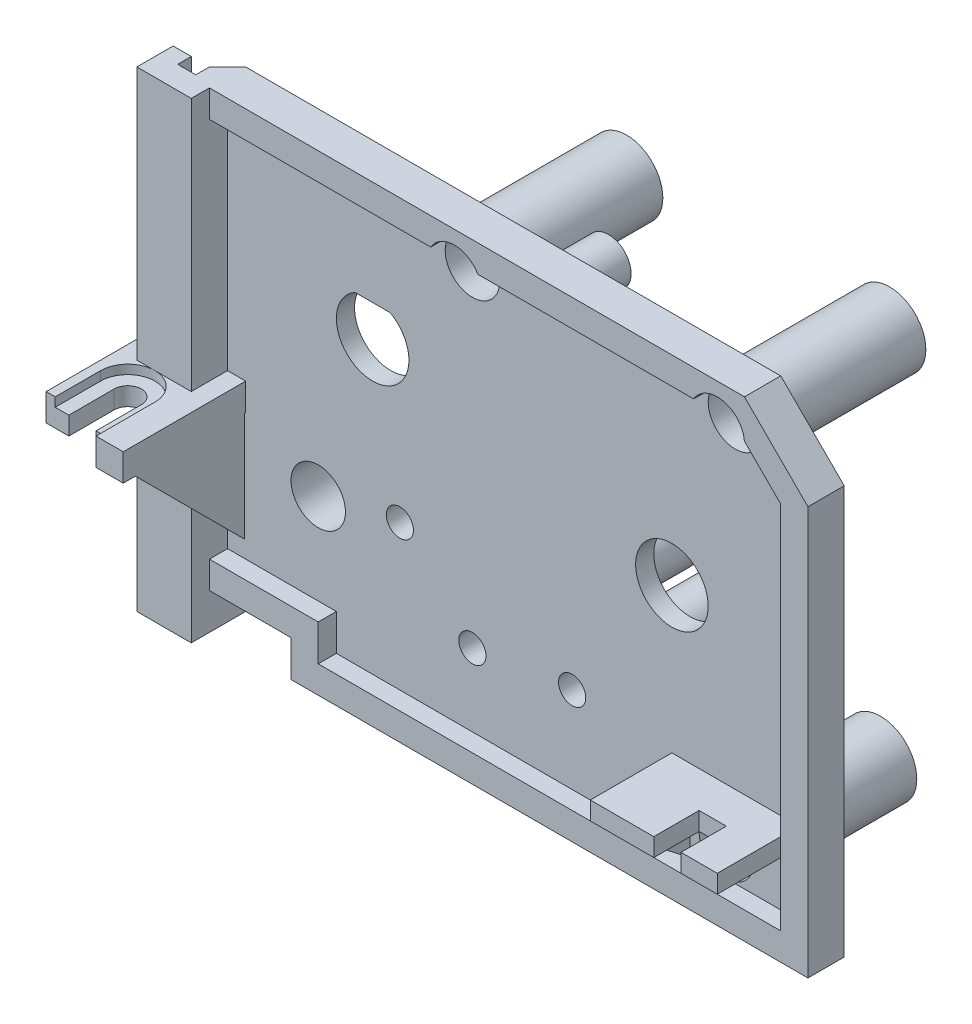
ISO-10303-21;
HEADER;
FILE_DESCRIPTION(('STEP AP214'),'2;1');
FILE_NAME('part.step','',(''),(''),'','','');
FILE_SCHEMA(('AUTOMOTIVE_DESIGN { 1 0 10303 214 1 1 1 1 }'));
ENDSEC;
DATA;
#1=APPLICATION_CONTEXT('core data for automotive mechanical design processes');
#2=APPLICATION_PROTOCOL_DEFINITION('international standard','automotive_design',2000,#1);
#3=PRODUCT_CONTEXT('',#1,'mechanical');
#4=PRODUCT('Part','Part','',(#3));
#5=PRODUCT_RELATED_PRODUCT_CATEGORY('part','',(#4));
#6=PRODUCT_DEFINITION_FORMATION('','',#4);
#7=PRODUCT_DEFINITION_CONTEXT('part definition',#1,'design');
#8=PRODUCT_DEFINITION('design','',#6,#7);
#9=PRODUCT_DEFINITION_SHAPE('','',#8);
#10=(LENGTH_UNIT() NAMED_UNIT(*) SI_UNIT(.MILLI.,.METRE.));
#11=(NAMED_UNIT(*) PLANE_ANGLE_UNIT() SI_UNIT($,.RADIAN.));
#12=(NAMED_UNIT(*) SI_UNIT($,.STERADIAN.) SOLID_ANGLE_UNIT());
#13=UNCERTAINTY_MEASURE_WITH_UNIT(LENGTH_MEASURE(1.E-05),#10,'distance_accuracy_value','');
#14=(GEOMETRIC_REPRESENTATION_CONTEXT(3) GLOBAL_UNCERTAINTY_ASSIGNED_CONTEXT((#13)) GLOBAL_UNIT_ASSIGNED_CONTEXT((#10,
#11,#12)) REPRESENTATION_CONTEXT('',''));
#15=CARTESIAN_POINT('',(0.,0.,0.));
#16=DIRECTION('',(0.,0.,1.));
#17=DIRECTION('',(1.,0.,0.));
#18=AXIS2_PLACEMENT_3D('',#15,#16,#17);
#19=CARTESIAN_POINT('',(3.00000000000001,49.,-2.));
#20=DIRECTION('',(0.,0.,1.));
#21=DIRECTION('',(1.,0.,0.));
#22=AXIS2_PLACEMENT_3D('',#19,#20,#21);
#23=PLANE('',#22);
#24=DIRECTION('',(-1.,0.,0.));
#25=VECTOR('',#24,1.);
#26=CARTESIAN_POINT('',(40.,10.,-2.));
#27=LINE('',#26,#25);
#28=CARTESIAN_POINT('',(54.,10.,-2.));
#29=VERTEX_POINT('',#28);
#30=CARTESIAN_POINT('',(42.,10.,-2.));
#31=VERTEX_POINT('',#30);
#32=EDGE_CURVE('E371',#29,#31,#27,.T.);
#33=ORIENTED_EDGE('',*,*,#32,.T.);
#34=DIRECTION('',(0.,-1.,0.));
#35=VECTOR('',#34,1.);
#36=CARTESIAN_POINT('',(42.,10.,-2.));
#37=LINE('',#36,#35);
#38=CARTESIAN_POINT('',(42.,3.,-2.));
#39=VERTEX_POINT('',#38);
#40=EDGE_CURVE('E724',#31,#39,#37,.T.);
#41=ORIENTED_EDGE('',*,*,#40,.T.);
#42=DIRECTION('',(1.,0.,0.));
#43=VECTOR('',#42,1.);
#44=CARTESIAN_POINT('',(3.,3.,-2.));
#45=LINE('',#44,#43);
#46=CARTESIAN_POINT('',(46.,3.,-2.));
#47=VERTEX_POINT('',#46);
#48=EDGE_CURVE('E1139',#39,#47,#45,.T.);
#49=ORIENTED_EDGE('',*,*,#48,.T.);
#50=CARTESIAN_POINT('',(46.,6.,-2.));
#51=DIRECTION('',(0.,0.,1.));
#52=DIRECTION('',(1.,0.,0.));
#53=AXIS2_PLACEMENT_3D('',#50,#51,#52);
#54=CIRCLE('',#53,3.);
#55=EDGE_CURVE('E962',#47,#47,#54,.T.);
#56=ORIENTED_EDGE('',*,*,#55,.F.);
#57=CARTESIAN_POINT('',(54.,3.,-2.));
#58=VERTEX_POINT('',#57);
#59=EDGE_CURVE('E1134',#47,#58,#45,.T.);
#60=ORIENTED_EDGE('',*,*,#59,.T.);
#61=DIRECTION('',(0.,1.,0.));
#62=VECTOR('',#61,1.);
#63=CARTESIAN_POINT('',(54.,3.,-2.));
#64=LINE('',#63,#62);
#65=EDGE_CURVE('E743',#58,#29,#64,.T.);
#66=ORIENTED_EDGE('',*,*,#65,.T.);
#67=EDGE_LOOP('',(#33,#41,#49,#56,#60,#66));
#68=FACE_BOUND('',#67,.T.);
#69=ADVANCED_FACE('F348',(#68),#23,.T.);
#70=CARTESIAN_POINT('',(3.,3.,-2.));
#71=DIRECTION('',(0.,-1.,0.));
#72=DIRECTION('',(0.,0.,-1.));
#73=AXIS2_PLACEMENT_3D('',#70,#71,#72);
#74=PLANE('',#73);
#75=DIRECTION('',(0.,0.,-1.));
#76=VECTOR('',#75,1.);
#77=CARTESIAN_POINT('',(42.,3.,-2.));
#78=LINE('',#77,#76);
#79=CARTESIAN_POINT('',(42.,3.,-1.99468120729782));
#80=VERTEX_POINT('',#79);
#81=EDGE_CURVE('E730',#80,#39,#78,.T.);
#82=ORIENTED_EDGE('',*,*,#81,.F.);
#83=DIRECTION('',(-1.,0.,0.));
#84=VECTOR('',#83,1.);
#85=CARTESIAN_POINT('',(3.,3.,-1.99468120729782));
#86=LINE('',#85,#84);
#87=CARTESIAN_POINT('',(40.,3.,-1.99468120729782));
#88=VERTEX_POINT('',#87);
#89=EDGE_CURVE('E1667',#80,#88,#86,.T.);
#90=ORIENTED_EDGE('',*,*,#89,.T.);
#91=DIRECTION('',(0.,0.,-1.));
#92=VECTOR('',#91,1.);
#93=CARTESIAN_POINT('',(40.,3.,-2.));
#94=LINE('',#93,#92);
#95=CARTESIAN_POINT('',(40.,3.,-2.));
#96=VERTEX_POINT('',#95);
#97=EDGE_CURVE('E1671',#88,#96,#94,.T.);
#98=ORIENTED_EDGE('',*,*,#97,.T.);
#99=CARTESIAN_POINT('',(3.,3.,-2.));
#100=VERTEX_POINT('',#99);
#101=EDGE_CURVE('E1135',#100,#96,#45,.T.);
#102=ORIENTED_EDGE('',*,*,#101,.F.);
#103=DIRECTION('',(0.,0.,1.));
#104=VECTOR('',#103,1.);
#105=CARTESIAN_POINT('',(3.,3.,-2.));
#106=LINE('',#105,#104);
#107=CARTESIAN_POINT('',(3.,3.,0.));
#108=VERTEX_POINT('',#107);
#109=EDGE_CURVE('E1151',#100,#108,#106,.T.);
#110=ORIENTED_EDGE('',*,*,#109,.T.);
#111=DIRECTION('',(1.,0.,0.));
#112=VECTOR('',#111,1.);
#113=CARTESIAN_POINT('',(3.,3.,0.));
#114=LINE('',#113,#112);
#115=CARTESIAN_POINT('',(54.,3.,0.));
#116=VERTEX_POINT('',#115);
#117=EDGE_CURVE('E1113',#108,#116,#114,.T.);
#118=ORIENTED_EDGE('',*,*,#117,.T.);
#119=DIRECTION('',(0.,0.,1.));
#120=VECTOR('',#119,1.);
#121=CARTESIAN_POINT('',(54.,3.,-2.));
#122=LINE('',#121,#120);
#123=EDGE_CURVE('E1149',#58,#116,#122,.T.);
#124=ORIENTED_EDGE('',*,*,#123,.F.);
#125=ORIENTED_EDGE('',*,*,#59,.F.);
#126=ORIENTED_EDGE('',*,*,#48,.F.);
#127=EDGE_LOOP('',(#82,#90,#98,#102,#110,#118,#124,#125,#126));
#128=FACE_BOUND('',#127,.T.);
#129=ADVANCED_FACE('F1283',(#128),#74,.F.);
#130=CARTESIAN_POINT('',(40.,10.,-16.142135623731));
#131=DIRECTION('',(0.,-1.,0.));
#132=DIRECTION('',(0.,0.,-1.));
#133=AXIS2_PLACEMENT_3D('',#130,#131,#132);
#134=PLANE('',#133);
#135=DIRECTION('',(1.,0.,0.));
#136=VECTOR('',#135,1.);
#137=CARTESIAN_POINT('',(40.,10.,7.));
#138=LINE('',#137,#136);
#139=CARTESIAN_POINT('',(42.,10.,7.));
#140=VERTEX_POINT('',#139);
#141=CARTESIAN_POINT('',(47.,10.,7.));
#142=VERTEX_POINT('',#141);
#143=EDGE_CURVE('E737',#140,#142,#138,.T.);
#144=ORIENTED_EDGE('',*,*,#143,.F.);
#145=DIRECTION('',(0.,0.,-1.));
#146=VECTOR('',#145,1.);
#147=CARTESIAN_POINT('',(42.,10.,7.));
#148=LINE('',#147,#146);
#149=EDGE_CURVE('E727',#140,#31,#148,.T.);
#150=ORIENTED_EDGE('',*,*,#149,.T.);
#151=ORIENTED_EDGE('',*,*,#32,.F.);
#152=DIRECTION('',(0.,0.,1.));
#153=VECTOR('',#152,1.);
#154=CARTESIAN_POINT('',(54.,10.,-16.142135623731));
#155=LINE('',#154,#153);
#156=CARTESIAN_POINT('',(54.,10.,0.));
#157=VERTEX_POINT('',#156);
#158=EDGE_CURVE('E753',#29,#157,#155,.T.);
#159=ORIENTED_EDGE('',*,*,#158,.T.);
#160=CARTESIAN_POINT('',(54.,10.,7.));
#161=VERTEX_POINT('',#160);
#162=EDGE_CURVE('E1631',#157,#161,#155,.T.);
#163=ORIENTED_EDGE('',*,*,#162,.T.);
#164=CARTESIAN_POINT('',(50.,10.,7.));
#165=VERTEX_POINT('',#164);
#166=EDGE_CURVE('E1621',#165,#161,#138,.T.);
#167=ORIENTED_EDGE('',*,*,#166,.F.);
#168=DIRECTION('',(0.,0.,1.));
#169=VECTOR('',#168,1.);
#170=CARTESIAN_POINT('',(50.,10.,2.));
#171=LINE('',#170,#169);
#172=CARTESIAN_POINT('',(50.,10.,2.));
#173=VERTEX_POINT('',#172);
#174=EDGE_CURVE('E363',#173,#165,#171,.T.);
#175=ORIENTED_EDGE('',*,*,#174,.F.);
#176=DIRECTION('',(1.,0.,0.));
#177=VECTOR('',#176,1.);
#178=CARTESIAN_POINT('',(47.,10.,2.));
#179=LINE('',#178,#177);
#180=CARTESIAN_POINT('',(47.,10.,2.));
#181=VERTEX_POINT('',#180);
#182=EDGE_CURVE('E1656',#181,#173,#179,.T.);
#183=ORIENTED_EDGE('',*,*,#182,.F.);
#184=DIRECTION('',(0.,0.,1.));
#185=VECTOR('',#184,1.);
#186=CARTESIAN_POINT('',(47.,10.,2.));
#187=LINE('',#186,#185);
#188=EDGE_CURVE('E1615',#181,#142,#187,.T.);
#189=ORIENTED_EDGE('',*,*,#188,.T.);
#190=EDGE_LOOP('',(#144,#150,#151,#159,#163,#167,#175,#183,#189));
#191=FACE_BOUND('',#190,.T.);
#192=ADVANCED_FACE('F735',(#191),#134,.T.);
#193=CARTESIAN_POINT('',(40.,10.,7.));
#194=DIRECTION('',(0.,0.,1.));
#195=DIRECTION('',(1.,0.,0.));
#196=AXIS2_PLACEMENT_3D('',#193,#194,#195);
#197=PLANE('',#196);
#198=DIRECTION('',(0.,-1.,0.));
#199=VECTOR('',#198,1.);
#200=CARTESIAN_POINT('',(47.,12.,7.));
#201=LINE('',#200,#199);
#202=CARTESIAN_POINT('',(47.,12.,7.));
#203=VERTEX_POINT('',#202);
#204=EDGE_CURVE('E1664',#203,#142,#201,.T.);
#205=ORIENTED_EDGE('',*,*,#204,.F.);
#206=DIRECTION('',(-1.,0.,0.));
#207=VECTOR('',#206,1.);
#208=CARTESIAN_POINT('',(40.,12.,7.));
#209=LINE('',#208,#207);
#210=CARTESIAN_POINT('',(40.,12.,7.));
#211=VERTEX_POINT('',#210);
#212=EDGE_CURVE('E1628',#203,#211,#209,.T.);
#213=ORIENTED_EDGE('',*,*,#212,.T.);
#214=DIRECTION('',(0.,-1.,0.));
#215=VECTOR('',#214,1.);
#216=CARTESIAN_POINT('',(40.,12.,7.));
#217=LINE('',#216,#215);
#218=CARTESIAN_POINT('',(40.,10.,7.));
#219=VERTEX_POINT('',#218);
#220=EDGE_CURVE('E1618',#211,#219,#217,.T.);
#221=ORIENTED_EDGE('',*,*,#220,.T.);
#222=EDGE_CURVE('E1623',#219,#140,#138,.T.);
#223=ORIENTED_EDGE('',*,*,#222,.T.);
#224=ORIENTED_EDGE('',*,*,#143,.T.);
#225=EDGE_LOOP('',(#205,#213,#221,#223,#224));
#226=FACE_BOUND('',#225,.T.);
#227=ADVANCED_FACE('F1589',(#226),#197,.T.);
#228=CARTESIAN_POINT('',(54.,3.,-2.));
#229=DIRECTION('',(1.,0.,0.));
#230=DIRECTION('',(0.,1.,0.));
#231=AXIS2_PLACEMENT_3D('',#228,#229,#230);
#232=PLANE('',#231);
#233=CARTESIAN_POINT('',(54.,12.,-2.));
#234=VERTEX_POINT('',#233);
#235=CARTESIAN_POINT('',(54.,43.7573593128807,-2.));
#236=VERTEX_POINT('',#235);
#237=EDGE_CURVE('E1138',#234,#236,#64,.T.);
#238=ORIENTED_EDGE('',*,*,#237,.F.);
#239=DIRECTION('',(0.,0.,1.));
#240=VECTOR('',#239,1.);
#241=CARTESIAN_POINT('',(54.,12.,-16.142135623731));
#242=LINE('',#241,#240);
#243=CARTESIAN_POINT('',(54.,12.,0.));
#244=VERTEX_POINT('',#243);
#245=EDGE_CURVE('E1604',#234,#244,#242,.T.);
#246=ORIENTED_EDGE('',*,*,#245,.T.);
#247=DIRECTION('',(0.,1.,0.));
#248=VECTOR('',#247,1.);
#249=CARTESIAN_POINT('',(54.,3.,0.));
#250=LINE('',#249,#248);
#251=CARTESIAN_POINT('',(54.,43.7573593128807,0.));
#252=VERTEX_POINT('',#251);
#253=EDGE_CURVE('E1116',#244,#252,#250,.T.);
#254=ORIENTED_EDGE('',*,*,#253,.T.);
#255=DIRECTION('',(0.,0.,1.));
#256=VECTOR('',#255,1.);
#257=CARTESIAN_POINT('',(54.,43.7573593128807,-2.));
#258=LINE('',#257,#256);
#259=EDGE_CURVE('E1145',#236,#252,#258,.T.);
#260=ORIENTED_EDGE('',*,*,#259,.F.);
#261=EDGE_LOOP('',(#238,#246,#254,#260));
#262=FACE_BOUND('',#261,.T.);
#263=ADVANCED_FACE('F1573',(#262),#232,.F.);
#264=CARTESIAN_POINT('',(-14.5,24.,10.));
#265=DIRECTION('',(1.,0.,0.));
#266=DIRECTION('',(0.,1.,0.));
#267=AXIS2_PLACEMENT_3D('',#264,#265,#266);
#268=PLANE('',#267);
#269=DIRECTION('',(0.,-1.,0.));
#270=VECTOR('',#269,1.);
#271=CARTESIAN_POINT('',(-14.5,24.,5.));
#272=LINE('',#271,#270);
#273=CARTESIAN_POINT('',(-14.5,23.,5.));
#274=VERTEX_POINT('',#273);
#275=CARTESIAN_POINT('',(-14.5,21.,5.));
#276=VERTEX_POINT('',#275);
#277=EDGE_CURVE('E884',#274,#276,#272,.T.);
#278=ORIENTED_EDGE('',*,*,#277,.F.);
#279=DIRECTION('',(0.,0.,-1.));
#280=VECTOR('',#279,1.);
#281=CARTESIAN_POINT('',(-14.5,23.,5.));
#282=LINE('',#281,#280);
#283=CARTESIAN_POINT('',(-14.5,23.,10.));
#284=VERTEX_POINT('',#283);
#285=EDGE_CURVE('E775',#284,#274,#282,.T.);
#286=ORIENTED_EDGE('',*,*,#285,.F.);
#287=DIRECTION('',(0.,-1.,0.));
#288=VECTOR('',#287,1.);
#289=CARTESIAN_POINT('',(-14.5,24.,10.));
#290=LINE('',#289,#288);
#291=CARTESIAN_POINT('',(-14.5,21.,10.));
#292=VERTEX_POINT('',#291);
#293=EDGE_CURVE('E882',#284,#292,#290,.T.);
#294=ORIENTED_EDGE('',*,*,#293,.T.);
#295=DIRECTION('',(0.,0.,1.));
#296=VECTOR('',#295,1.);
#297=CARTESIAN_POINT('',(-14.5,21.,10.));
#298=LINE('',#297,#296);
#299=EDGE_CURVE('E838',#276,#292,#298,.T.);
#300=ORIENTED_EDGE('',*,*,#299,.F.);
#301=EDGE_LOOP('',(#278,#286,#294,#300));
#302=FACE_BOUND('',#301,.T.);
#303=ADVANCED_FACE('F1588',(#302),#268,.T.);
#304=CARTESIAN_POINT('',(-13.,24.,5.));
#305=DIRECTION('',(0.,-1.,0.));
#306=DIRECTION('',(1.,0.,0.));
#307=AXIS2_PLACEMENT_3D('',#304,#305,#306);
#308=CYLINDRICAL_SURFACE('',#307,1.5);
#309=DIRECTION('',(0.,-1.,0.));
#310=VECTOR('',#309,1.);
#311=CARTESIAN_POINT('',(-11.5,24.,4.99999999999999));
#312=LINE('',#311,#310);
#313=CARTESIAN_POINT('',(-11.5,23.,4.99999999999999));
#314=VERTEX_POINT('',#313);
#315=CARTESIAN_POINT('',(-11.5,21.,4.99999999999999));
#316=VERTEX_POINT('',#315);
#317=EDGE_CURVE('E886',#314,#316,#312,.T.);
#318=ORIENTED_EDGE('',*,*,#317,.F.);
#319=CARTESIAN_POINT('',(-13.,23.,5.));
#320=DIRECTION('',(0.,-1.,0.));
#321=DIRECTION('',(-1.,0.,0.));
#322=AXIS2_PLACEMENT_3D('',#319,#320,#321);
#323=CIRCLE('',#322,1.5);
#324=EDGE_CURVE('E757',#274,#314,#323,.T.);
#325=ORIENTED_EDGE('',*,*,#324,.F.);
#326=ORIENTED_EDGE('',*,*,#277,.T.);
#327=CARTESIAN_POINT('',(-13.,21.,5.));
#328=DIRECTION('',(0.,1.,0.));
#329=DIRECTION('',(1.,0.,0.));
#330=AXIS2_PLACEMENT_3D('',#327,#328,#329);
#331=CIRCLE('',#330,1.5);
#332=EDGE_CURVE('E835',#316,#276,#331,.T.);
#333=ORIENTED_EDGE('',*,*,#332,.F.);
#334=EDGE_LOOP('',(#318,#325,#326,#333));
#335=FACE_BOUND('',#334,.T.);
#336=ADVANCED_FACE('F1595',(#335),#308,.F.);
#337=CARTESIAN_POINT('',(-11.5,24.,4.99999999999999));
#338=DIRECTION('',(-1.,0.,0.));
#339=DIRECTION('',(0.,0.,1.));
#340=AXIS2_PLACEMENT_3D('',#337,#338,#339);
#341=PLANE('',#340);
#342=DIRECTION('',(0.,-1.,0.));
#343=VECTOR('',#342,1.);
#344=CARTESIAN_POINT('',(-11.5,24.,9.99999999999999));
#345=LINE('',#344,#343);
#346=CARTESIAN_POINT('',(-11.5,23.,9.99999999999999));
#347=VERTEX_POINT('',#346);
#348=CARTESIAN_POINT('',(-11.5,21.,9.99999999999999));
#349=VERTEX_POINT('',#348);
#350=EDGE_CURVE('E888',#347,#349,#345,.T.);
#351=ORIENTED_EDGE('',*,*,#350,.F.);
#352=DIRECTION('',(0.,0.,1.));
#353=VECTOR('',#352,1.);
#354=CARTESIAN_POINT('',(-11.5,23.,9.99999999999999));
#355=LINE('',#354,#353);
#356=EDGE_CURVE('E759',#314,#347,#355,.T.);
#357=ORIENTED_EDGE('',*,*,#356,.F.);
#358=ORIENTED_EDGE('',*,*,#317,.T.);
#359=DIRECTION('',(0.,0.,-1.));
#360=VECTOR('',#359,1.);
#361=CARTESIAN_POINT('',(-11.5,21.,4.99999999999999));
#362=LINE('',#361,#360);
#363=EDGE_CURVE('E832',#349,#316,#362,.T.);
#364=ORIENTED_EDGE('',*,*,#363,.F.);
#365=EDGE_LOOP('',(#351,#357,#358,#364));
#366=FACE_BOUND('',#365,.T.);
#367=ADVANCED_FACE('F1745',(#366),#341,.T.);
#368=CARTESIAN_POINT('',(-11.5,24.,9.99999999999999));
#369=DIRECTION('',(0.,0.,1.));
#370=DIRECTION('',(1.,0.,0.));
#371=AXIS2_PLACEMENT_3D('',#368,#369,#370);
#372=PLANE('',#371);
#373=DIRECTION('',(0.,-1.,0.));
#374=VECTOR('',#373,1.);
#375=CARTESIAN_POINT('',(-10.,24.,10.));
#376=LINE('',#375,#374);
#377=CARTESIAN_POINT('',(-10.,23.,9.99999999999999));
#378=VERTEX_POINT('',#377);
#379=CARTESIAN_POINT('',(-10.,21.,10.));
#380=VERTEX_POINT('',#379);
#381=EDGE_CURVE('E890',#378,#380,#376,.T.);
#382=ORIENTED_EDGE('',*,*,#381,.F.);
#383=DIRECTION('',(1.,0.,0.));
#384=VECTOR('',#383,1.);
#385=CARTESIAN_POINT('',(-10.,23.,9.99999999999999));
#386=LINE('',#385,#384);
#387=EDGE_CURVE('E761',#347,#378,#386,.T.);
#388=ORIENTED_EDGE('',*,*,#387,.F.);
#389=ORIENTED_EDGE('',*,*,#350,.T.);
#390=DIRECTION('',(-1.,0.,0.));
#391=VECTOR('',#390,1.);
#392=CARTESIAN_POINT('',(-11.5,21.,9.99999999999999));
#393=LINE('',#392,#391);
#394=EDGE_CURVE('E829',#380,#349,#393,.T.);
#395=ORIENTED_EDGE('',*,*,#394,.F.);
#396=EDGE_LOOP('',(#382,#388,#389,#395));
#397=FACE_BOUND('',#396,.T.);
#398=ADVANCED_FACE('F1305',(#397),#372,.T.);
#399=CARTESIAN_POINT('',(-13.,24.,5.));
#400=DIRECTION('',(0.,-1.,0.));
#401=DIRECTION('',(1.,0.,0.));
#402=AXIS2_PLACEMENT_3D('',#399,#400,#401);
#403=PLANE('',#402);
#404=DIRECTION('',(-1.,0.,0.));
#405=VECTOR('',#404,1.);
#406=CARTESIAN_POINT('',(-17.,24.,10.));
#407=LINE('',#406,#405);
#408=CARTESIAN_POINT('',(-16.,24.,10.));
#409=VERTEX_POINT('',#408);
#410=CARTESIAN_POINT('',(-17.,24.,10.));
#411=VERTEX_POINT('',#410);
#412=EDGE_CURVE('E868',#409,#411,#407,.T.);
#413=ORIENTED_EDGE('',*,*,#412,.F.);
#414=DIRECTION('',(0.,0.,1.));
#415=VECTOR('',#414,1.);
#416=CARTESIAN_POINT('',(-16.,24.,5.));
#417=LINE('',#416,#415);
#418=CARTESIAN_POINT('',(-16.,24.,5.));
#419=VERTEX_POINT('',#418);
#420=EDGE_CURVE('E747',#419,#409,#417,.T.);
#421=ORIENTED_EDGE('',*,*,#420,.F.);
#422=CARTESIAN_POINT('',(-13.,24.,5.));
#423=DIRECTION('',(0.,-1.,0.));
#424=DIRECTION('',(1.,0.,0.));
#425=AXIS2_PLACEMENT_3D('',#422,#423,#424);
#426=CIRCLE('',#425,3.);
#427=CARTESIAN_POINT('',(-13.,24.,2.));
#428=VERTEX_POINT('',#427);
#429=EDGE_CURVE('E11',#419,#428,#426,.T.);
#430=ORIENTED_EDGE('',*,*,#429,.T.);
#431=DIRECTION('',(1.,0.,0.));
#432=VECTOR('',#431,1.);
#433=CARTESIAN_POINT('',(-9.,24.,2.));
#434=LINE('',#433,#432);
#435=CARTESIAN_POINT('',(-15.,24.,2.));
#436=VERTEX_POINT('',#435);
#437=EDGE_CURVE('E853',#436,#428,#434,.T.);
#438=ORIENTED_EDGE('',*,*,#437,.F.);
#439=DIRECTION('',(0.,0.,1.));
#440=VECTOR('',#439,1.);
#441=CARTESIAN_POINT('',(-15.,24.,2.));
#442=LINE('',#441,#440);
#443=CARTESIAN_POINT('',(-15.,24.,-2.));
#444=VERTEX_POINT('',#443);
#445=EDGE_CURVE('E850',#444,#436,#442,.T.);
#446=ORIENTED_EDGE('',*,*,#445,.F.);
#447=DIRECTION('',(1.,0.,0.));
#448=VECTOR('',#447,1.);
#449=CARTESIAN_POINT('',(-15.,24.,-2.));
#450=LINE('',#449,#448);
#451=CARTESIAN_POINT('',(-17.,24.,-2.));
#452=VERTEX_POINT('',#451);
#453=EDGE_CURVE('E873',#452,#444,#450,.T.);
#454=ORIENTED_EDGE('',*,*,#453,.F.);
#455=DIRECTION('',(0.,0.,-1.));
#456=VECTOR('',#455,1.);
#457=CARTESIAN_POINT('',(-17.,24.,-2.));
#458=LINE('',#457,#456);
#459=EDGE_CURVE('E870',#411,#452,#458,.T.);
#460=ORIENTED_EDGE('',*,*,#459,.F.);
#461=EDGE_LOOP('',(#413,#421,#430,#438,#446,#454,#460));
#462=FACE_BOUND('',#461,.T.);
#463=ADVANCED_FACE('F1295',(#462),#403,.F.);
#464=ORIENTED_EDGE('',*,*,#101,.T.);
#465=DIRECTION('',(0.,1.,0.));
#466=VECTOR('',#465,1.);
#467=CARTESIAN_POINT('',(40.,12.,-2.));
#468=LINE('',#467,#466);
#469=CARTESIAN_POINT('',(40.,12.,-2.));
#470=VERTEX_POINT('',#469);
#471=EDGE_CURVE('E745',#96,#470,#468,.T.);
#472=ORIENTED_EDGE('',*,*,#471,.T.);
#473=DIRECTION('',(1.,0.,0.));
#474=VECTOR('',#473,1.);
#475=CARTESIAN_POINT('',(40.,12.,-2.));
#476=LINE('',#475,#474);
#477=EDGE_CURVE('E750',#470,#234,#476,.T.);
#478=ORIENTED_EDGE('',*,*,#477,.T.);
#479=ORIENTED_EDGE('',*,*,#237,.T.);
#480=DIRECTION('',(-0.707106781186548,0.707106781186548,0.));
#481=VECTOR('',#480,1.);
#482=CARTESIAN_POINT('',(54.,43.7573593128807,-2.));
#483=LINE('',#482,#481);
#484=CARTESIAN_POINT('',(49.9878715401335,47.7694877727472,-2.));
#485=VERTEX_POINT('',#484);
#486=EDGE_CURVE('E1141',#236,#485,#483,.T.);
#487=ORIENTED_EDGE('',*,*,#486,.T.);
#488=CARTESIAN_POINT('',(47.,47.5,-2.));
#489=DIRECTION('',(0.,0.,1.));
#490=DIRECTION('',(1.,0.,0.));
#491=AXIS2_PLACEMENT_3D('',#488,#489,#490);
#492=CIRCLE('',#491,3.);
#493=CARTESIAN_POINT('',(44.4019237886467,49.,-2.));
#494=VERTEX_POINT('',#493);
#495=EDGE_CURVE('E955',#494,#485,#492,.T.);
#496=ORIENTED_EDGE('',*,*,#495,.F.);
#497=DIRECTION('',(-1.,0.,0.));
#498=VECTOR('',#497,1.);
#499=CARTESIAN_POINT('',(48.7573593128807,49.,-2.));
#500=LINE('',#499,#498);
#501=CARTESIAN_POINT('',(26.,49.,-2.));
#502=VERTEX_POINT('',#501);
#503=EDGE_CURVE('E1127',#494,#502,#500,.T.);
#504=ORIENTED_EDGE('',*,*,#503,.T.);
#505=CARTESIAN_POINT('',(26.,48.5,-2.));
#506=DIRECTION('',(0.,0.,1.));
#507=DIRECTION('',(1.,0.,0.));
#508=AXIS2_PLACEMENT_3D('',#505,#506,#507);
#509=CIRCLE('',#508,0.499999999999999);
#510=EDGE_CURVE('E911',#502,#502,#509,.T.);
#511=ORIENTED_EDGE('',*,*,#510,.F.);
#512=CARTESIAN_POINT('',(20.5980762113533,49.,-2.));
#513=VERTEX_POINT('',#512);
#514=EDGE_CURVE('E1126',#502,#513,#500,.T.);
#515=ORIENTED_EDGE('',*,*,#514,.T.);
#516=CARTESIAN_POINT('',(18.,47.5,-2.));
#517=DIRECTION('',(0.,0.,1.));
#518=DIRECTION('',(1.,0.,0.));
#519=AXIS2_PLACEMENT_3D('',#516,#517,#518);
#520=CIRCLE('',#519,3.);
#521=CARTESIAN_POINT('',(15.4019237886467,49.,-2.));
#522=VERTEX_POINT('',#521);
#523=EDGE_CURVE('E948',#522,#513,#520,.T.);
#524=ORIENTED_EDGE('',*,*,#523,.F.);
#525=CARTESIAN_POINT('',(-9.00000000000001,49.,-2.));
#526=VERTEX_POINT('',#525);
#527=EDGE_CURVE('E1124',#522,#526,#500,.T.);
#528=ORIENTED_EDGE('',*,*,#527,.T.);
#529=DIRECTION('',(0.,-1.,0.));
#530=VECTOR('',#529,1.);
#531=CARTESIAN_POINT('',(-9.00000000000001,49.,-2.));
#532=LINE('',#531,#530);
#533=CARTESIAN_POINT('',(-9.00000000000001,24.,-2.));
#534=VERTEX_POINT('',#533);
#535=EDGE_CURVE('E1095',#526,#534,#532,.T.);
#536=ORIENTED_EDGE('',*,*,#535,.T.);
#537=DIRECTION('',(1.,0.,0.));
#538=VECTOR('',#537,1.);
#539=CARTESIAN_POINT('',(-7.,24.,-2.));
#540=LINE('',#539,#538);
#541=CARTESIAN_POINT('',(-7.,24.,-2.));
#542=VERTEX_POINT('',#541);
#543=EDGE_CURVE('E858',#534,#542,#540,.T.);
#544=ORIENTED_EDGE('',*,*,#543,.T.);
#545=DIRECTION('',(0.,-1.,0.));
#546=VECTOR('',#545,1.);
#547=CARTESIAN_POINT('',(-7.,24.,-2.));
#548=LINE('',#547,#546);
#549=CARTESIAN_POINT('',(-7.,21.,-2.));
#550=VERTEX_POINT('',#549);
#551=EDGE_CURVE('E876',#542,#550,#548,.T.);
#552=ORIENTED_EDGE('',*,*,#551,.T.);
#553=DIRECTION('',(1.,0.,0.));
#554=VECTOR('',#553,1.);
#555=CARTESIAN_POINT('',(-7.,21.,-2.));
#556=LINE('',#555,#554);
#557=CARTESIAN_POINT('',(-9.00000000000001,21.,-2.));
#558=VERTEX_POINT('',#557);
#559=EDGE_CURVE('E817',#558,#550,#556,.T.);
#560=ORIENTED_EDGE('',*,*,#559,.F.);
#561=CARTESIAN_POINT('',(-9.00000000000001,7.,-2.));
#562=VERTEX_POINT('',#561);
#563=EDGE_CURVE('E1094',#558,#562,#532,.T.);
#564=ORIENTED_EDGE('',*,*,#563,.T.);
#565=DIRECTION('',(1.,0.,0.));
#566=VECTOR('',#565,1.);
#567=CARTESIAN_POINT('',(-6.,7.,-2.));
#568=LINE('',#567,#566);
#569=CARTESIAN_POINT('',(3.,7.,-2.));
#570=VERTEX_POINT('',#569);
#571=EDGE_CURVE('E1128',#562,#570,#568,.T.);
#572=ORIENTED_EDGE('',*,*,#571,.T.);
#573=DIRECTION('',(0.,-1.,0.));
#574=VECTOR('',#573,1.);
#575=CARTESIAN_POINT('',(3.,7.,-2.));
#576=LINE('',#575,#574);
#577=EDGE_CURVE('E1131',#570,#100,#576,.T.);
#578=ORIENTED_EDGE('',*,*,#577,.T.);
#579=EDGE_LOOP('',(#464,#472,#478,#479,#487,#496,#504,#511,#515,#524,#528,#536,#544,#552,#560,
#564,#572,#578));
#580=FACE_BOUND('',#579,.T.);
#581=CARTESIAN_POINT('',(40.,28.,-2.));
#582=DIRECTION('',(0.,0.,1.));
#583=DIRECTION('',(1.,0.,0.));
#584=AXIS2_PLACEMENT_3D('',#581,#582,#583);
#585=CIRCLE('',#584,4.00000000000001);
#586=CARTESIAN_POINT('',(44.,28.,-2.));
#587=VERTEX_POINT('',#586);
#588=EDGE_CURVE('E1086',#587,#587,#585,.T.);
#589=ORIENTED_EDGE('',*,*,#588,.F.);
#590=EDGE_LOOP('',(#589));
#591=FACE_BOUND('',#590,.T.);
#592=CARTESIAN_POINT('',(7.,35.,-2.));
#593=DIRECTION('',(0.,0.,1.));
#594=DIRECTION('',(1.,0.,0.));
#595=AXIS2_PLACEMENT_3D('',#592,#593,#594);
#596=CIRCLE('',#595,4.);
#597=CARTESIAN_POINT('',(5.0635083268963,38.5,-2.));
#598=VERTEX_POINT('',#597);
#599=CARTESIAN_POINT('',(8.9364916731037,38.5,-2.));
#600=VERTEX_POINT('',#599);
#601=EDGE_CURVE('E1072',#598,#600,#596,.T.);
#602=ORIENTED_EDGE('',*,*,#601,.F.);
#603=DIRECTION('',(-1.,0.,0.));
#604=VECTOR('',#603,1.);
#605=CARTESIAN_POINT('',(5.0635083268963,38.5,-2.));
#606=LINE('',#605,#604);
#607=EDGE_CURVE('E1074',#600,#598,#606,.T.);
#608=ORIENTED_EDGE('',*,*,#607,.F.);
#609=EDGE_LOOP('',(#602,#608));
#610=FACE_BOUND('',#609,.T.);
#611=CARTESIAN_POINT('',(0.999999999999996,17.,-2.));
#612=DIRECTION('',(0.,0.,1.));
#613=DIRECTION('',(1.,0.,0.));
#614=AXIS2_PLACEMENT_3D('',#611,#612,#613);
#615=CIRCLE('',#614,3.);
#616=CARTESIAN_POINT('',(3.99999999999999,17.,-2.));
#617=VERTEX_POINT('',#616);
#618=EDGE_CURVE('E941',#617,#617,#615,.T.);
#619=ORIENTED_EDGE('',*,*,#618,.F.);
#620=EDGE_LOOP('',(#619));
#621=FACE_BOUND('',#620,.T.);
#622=CARTESIAN_POINT('',(10.,19.,-2.));
#623=DIRECTION('',(0.,0.,1.));
#624=DIRECTION('',(1.,0.,0.));
#625=AXIS2_PLACEMENT_3D('',#622,#623,#624);
#626=CIRCLE('',#625,1.5);
#627=CARTESIAN_POINT('',(11.5,19.,-2.));
#628=VERTEX_POINT('',#627);
#629=EDGE_CURVE('E905',#628,#628,#626,.T.);
#630=ORIENTED_EDGE('',*,*,#629,.F.);
#631=EDGE_LOOP('',(#630));
#632=FACE_BOUND('',#631,.T.);
#633=CARTESIAN_POINT('',(18.,11.,-2.));
#634=DIRECTION('',(0.,0.,1.));
#635=DIRECTION('',(1.,0.,0.));
#636=AXIS2_PLACEMENT_3D('',#633,#634,#635);
#637=CIRCLE('',#636,1.5);
#638=CARTESIAN_POINT('',(19.5,11.,-2.));
#639=VERTEX_POINT('',#638);
#640=EDGE_CURVE('E901',#639,#639,#637,.T.);
#641=ORIENTED_EDGE('',*,*,#640,.F.);
#642=EDGE_LOOP('',(#641));
#643=FACE_BOUND('',#642,.T.);
#644=CARTESIAN_POINT('',(29.,12.5,-2.));
#645=DIRECTION('',(0.,0.,1.));
#646=DIRECTION('',(1.,0.,0.));
#647=AXIS2_PLACEMENT_3D('',#644,#645,#646);
#648=CIRCLE('',#647,1.5);
#649=CARTESIAN_POINT('',(30.5,12.5,-2.));
#650=VERTEX_POINT('',#649);
#651=EDGE_CURVE('E879',#650,#650,#648,.T.);
#652=ORIENTED_EDGE('',*,*,#651,.F.);
#653=EDGE_LOOP('',(#652));
#654=FACE_BOUND('',#653,.T.);
#655=ADVANCED_FACE('F1285',(#580,#591,#610,#621,#632,#643,#654),#23,.T.);
#656=CARTESIAN_POINT('',(-9.00000000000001,52.,2.));
#657=DIRECTION('',(1.,0.,0.));
#658=DIRECTION('',(0.,1.,0.));
#659=AXIS2_PLACEMENT_3D('',#656,#657,#658);
#660=PLANE('',#659);
#661=DIRECTION('',(0.,-1.,0.));
#662=VECTOR('',#661,1.);
#663=CARTESIAN_POINT('',(-9.00000000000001,52.,2.));
#664=LINE('',#663,#662);
#665=CARTESIAN_POINT('',(-9.00000000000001,52.,2.));
#666=VERTEX_POINT('',#665);
#667=CARTESIAN_POINT('',(-9.,24.,2.));
#668=VERTEX_POINT('',#667);
#669=EDGE_CURVE('E1064',#666,#668,#664,.T.);
#670=ORIENTED_EDGE('',*,*,#669,.T.);
#671=DIRECTION('',(0.,0.,-1.));
#672=VECTOR('',#671,1.);
#673=CARTESIAN_POINT('',(-9.,24.,-2.));
#674=LINE('',#673,#672);
#675=EDGE_CURVE('E856',#668,#534,#674,.T.);
#676=ORIENTED_EDGE('',*,*,#675,.T.);
#677=ORIENTED_EDGE('',*,*,#535,.F.);
#678=DIRECTION('',(0.,0.,1.));
#679=VECTOR('',#678,1.);
#680=CARTESIAN_POINT('',(-9.00000000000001,49.,-2.));
#681=LINE('',#680,#679);
#682=CARTESIAN_POINT('',(-9.00000000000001,49.,0.));
#683=VERTEX_POINT('',#682);
#684=EDGE_CURVE('E1099',#526,#683,#681,.T.);
#685=ORIENTED_EDGE('',*,*,#684,.T.);
#686=DIRECTION('',(0.,-1.,0.));
#687=VECTOR('',#686,1.);
#688=CARTESIAN_POINT('',(-9.00000000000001,52.,0.));
#689=LINE('',#688,#687);
#690=CARTESIAN_POINT('',(-9.00000000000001,52.,0.));
#691=VERTEX_POINT('',#690);
#692=EDGE_CURVE('E1157',#691,#683,#689,.T.);
#693=ORIENTED_EDGE('',*,*,#692,.F.);
#694=DIRECTION('',(0.,0.,1.));
#695=VECTOR('',#694,1.);
#696=CARTESIAN_POINT('',(-9.00000000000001,52.,2.));
#697=LINE('',#696,#695);
#698=EDGE_CURVE('E1061',#691,#666,#697,.T.);
#699=ORIENTED_EDGE('',*,*,#698,.T.);
#700=EDGE_LOOP('',(#670,#676,#677,#685,#693,#699));
#701=FACE_BOUND('',#700,.T.);
#702=ADVANCED_FACE('F1294',(#701),#660,.T.);
#703=CARTESIAN_POINT('',(-9.00000000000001,52.,2.));
#704=DIRECTION('',(0.,0.,1.));
#705=DIRECTION('',(1.,0.,0.));
#706=AXIS2_PLACEMENT_3D('',#703,#704,#705);
#707=PLANE('',#706);
#708=DIRECTION('',(0.,-1.,0.));
#709=VECTOR('',#708,1.);
#710=CARTESIAN_POINT('',(-15.,52.,2.));
#711=LINE('',#710,#709);
#712=CARTESIAN_POINT('',(-15.,52.,2.));
#713=VERTEX_POINT('',#712);
#714=EDGE_CURVE('E1409',#713,#436,#711,.T.);
#715=ORIENTED_EDGE('',*,*,#714,.T.);
#716=ORIENTED_EDGE('',*,*,#437,.T.);
#717=EDGE_CURVE('E852',#428,#668,#434,.T.);
#718=ORIENTED_EDGE('',*,*,#717,.T.);
#719=ORIENTED_EDGE('',*,*,#669,.F.);
#720=DIRECTION('',(-1.,0.,0.));
#721=VECTOR('',#720,1.);
#722=CARTESIAN_POINT('',(-9.00000000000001,52.,2.));
#723=LINE('',#722,#721);
#724=EDGE_CURVE('E1041',#666,#713,#723,.T.);
#725=ORIENTED_EDGE('',*,*,#724,.T.);
#726=EDGE_LOOP('',(#715,#716,#718,#719,#725));
#727=FACE_BOUND('',#726,.T.);
#728=ADVANCED_FACE('F1301',(#727),#707,.T.);
#729=CARTESIAN_POINT('',(-15.,52.,2.));
#730=DIRECTION('',(-1.,0.,0.));
#731=DIRECTION('',(0.,-1.,0.));
#732=AXIS2_PLACEMENT_3D('',#729,#730,#731);
#733=PLANE('',#732);
#734=DIRECTION('',(0.,-1.,0.));
#735=VECTOR('',#734,1.);
#736=CARTESIAN_POINT('',(-15.,52.,-2.));
#737=LINE('',#736,#735);
#738=CARTESIAN_POINT('',(-15.,52.,-2.));
#739=VERTEX_POINT('',#738);
#740=EDGE_CURVE('E1407',#739,#444,#737,.T.);
#741=ORIENTED_EDGE('',*,*,#740,.T.);
#742=ORIENTED_EDGE('',*,*,#445,.T.);
#743=ORIENTED_EDGE('',*,*,#714,.F.);
#744=DIRECTION('',(0.,0.,-1.));
#745=VECTOR('',#744,1.);
#746=CARTESIAN_POINT('',(-15.,52.,2.));
#747=LINE('',#746,#745);
#748=EDGE_CURVE('E1044',#713,#739,#747,.T.);
#749=ORIENTED_EDGE('',*,*,#748,.T.);
#750=EDGE_LOOP('',(#741,#742,#743,#749));
#751=FACE_BOUND('',#750,.T.);
#752=ADVANCED_FACE('F1246',(#751),#733,.T.);
#753=CARTESIAN_POINT('',(-9.,4.,-4.));
#754=DIRECTION('',(0.,0.,1.));
#755=DIRECTION('',(1.,0.,0.));
#756=AXIS2_PLACEMENT_3D('',#753,#754,#755);
#757=PLANE('',#756);
#758=CARTESIAN_POINT('',(29.,12.5,-4.));
#759=DIRECTION('',(0.,0.,1.));
#760=DIRECTION('',(1.,0.,0.));
#761=AXIS2_PLACEMENT_3D('',#758,#759,#760);
#762=CIRCLE('',#761,3.);
#763=CARTESIAN_POINT('',(32.,12.5,-4.));
#764=VERTEX_POINT('',#763);
#765=EDGE_CURVE('E1214',#764,#764,#762,.F.);
#766=ORIENTED_EDGE('',*,*,#765,.F.);
#767=EDGE_LOOP('',(#766));
#768=FACE_BOUND('',#767,.T.);
#769=CARTESIAN_POINT('',(10.,19.,-4.));
#770=DIRECTION('',(0.,0.,1.));
#771=DIRECTION('',(1.,0.,0.));
#772=AXIS2_PLACEMENT_3D('',#769,#770,#771);
#773=CIRCLE('',#772,2.5);
#774=CARTESIAN_POINT('',(12.5,19.,-4.));
#775=VERTEX_POINT('',#774);
#776=EDGE_CURVE('E1200',#775,#775,#773,.F.);
#777=ORIENTED_EDGE('',*,*,#776,.F.);
#778=EDGE_LOOP('',(#777));
#779=FACE_BOUND('',#778,.T.);
#780=CARTESIAN_POINT('',(0.999999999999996,17.,-4.));
#781=DIRECTION('',(0.,0.,1.));
#782=DIRECTION('',(1.,0.,0.));
#783=AXIS2_PLACEMENT_3D('',#780,#781,#782);
#784=CIRCLE('',#783,4.);
#785=CARTESIAN_POINT('',(5.,17.,-4.));
#786=VERTEX_POINT('',#785);
#787=EDGE_CURVE('E1194',#786,#786,#784,.F.);
#788=ORIENTED_EDGE('',*,*,#787,.F.);
#789=EDGE_LOOP('',(#788));
#790=FACE_BOUND('',#789,.T.);
#791=CARTESIAN_POINT('',(47.,47.5,-4.));
#792=DIRECTION('',(0.,0.,1.));
#793=DIRECTION('',(1.,0.,0.));
#794=AXIS2_PLACEMENT_3D('',#791,#792,#793);
#795=CIRCLE('',#794,4.);
#796=CARTESIAN_POINT('',(51.,47.5,-4.));
#797=VERTEX_POINT('',#796);
#798=EDGE_CURVE('E1187',#797,#797,#795,.F.);
#799=ORIENTED_EDGE('',*,*,#798,.F.);
#800=EDGE_LOOP('',(#799));
#801=FACE_BOUND('',#800,.T.);
#802=DIRECTION('',(-1.,0.,0.));
#803=VECTOR('',#802,1.);
#804=CARTESIAN_POINT('',(5.0635083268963,38.5,-4.));
#805=LINE('',#804,#803);
#806=CARTESIAN_POINT('',(8.9364916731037,38.5,-4.));
#807=VERTEX_POINT('',#806);
#808=CARTESIAN_POINT('',(5.0635083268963,38.5,-4.));
#809=VERTEX_POINT('',#808);
#810=EDGE_CURVE('E1080',#807,#809,#805,.T.);
#811=ORIENTED_EDGE('',*,*,#810,.T.);
#812=CARTESIAN_POINT('',(7.,35.,-4.));
#813=DIRECTION('',(0.,0.,1.));
#814=DIRECTION('',(1.,0.,0.));
#815=AXIS2_PLACEMENT_3D('',#812,#813,#814);
#816=CIRCLE('',#815,4.);
#817=EDGE_CURVE('E1077',#809,#807,#816,.T.);
#818=ORIENTED_EDGE('',*,*,#817,.T.);
#819=EDGE_LOOP('',(#811,#818));
#820=FACE_BOUND('',#819,.T.);
#821=CARTESIAN_POINT('',(40.,28.,-4.));
#822=DIRECTION('',(0.,0.,1.));
#823=DIRECTION('',(1.,0.,0.));
#824=AXIS2_PLACEMENT_3D('',#821,#822,#823);
#825=CIRCLE('',#824,4.00000000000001);
#826=CARTESIAN_POINT('',(44.,28.,-4.));
#827=VERTEX_POINT('',#826);
#828=EDGE_CURVE('E1091',#827,#827,#825,.T.);
#829=ORIENTED_EDGE('',*,*,#828,.T.);
#830=EDGE_LOOP('',(#829));
#831=FACE_BOUND('',#830,.T.);
#832=DIRECTION('',(0.,-1.,0.));
#833=VECTOR('',#832,1.);
#834=CARTESIAN_POINT('',(-9.00000000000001,52.,-4.));
#835=LINE('',#834,#833);
#836=CARTESIAN_POINT('',(-9.00000000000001,52.,-4.));
#837=VERTEX_POINT('',#836);
#838=CARTESIAN_POINT('',(-9.,4.,-4.));
#839=VERTEX_POINT('',#838);
#840=EDGE_CURVE('E1169',#837,#839,#835,.T.);
#841=ORIENTED_EDGE('',*,*,#840,.F.);
#842=DIRECTION('',(-1.,0.,0.));
#843=VECTOR('',#842,1.);
#844=CARTESIAN_POINT('',(-9.00000000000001,52.,-4.));
#845=LINE('',#844,#843);
#846=CARTESIAN_POINT('',(50.,52.,-4.));
#847=VERTEX_POINT('',#846);
#848=EDGE_CURVE('E1181',#847,#837,#845,.T.);
#849=ORIENTED_EDGE('',*,*,#848,.F.);
#850=DIRECTION('',(-0.707106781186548,0.707106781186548,0.));
#851=VECTOR('',#850,1.);
#852=CARTESIAN_POINT('',(50.,52.,-4.));
#853=LINE('',#852,#851);
#854=CARTESIAN_POINT('',(57.,45.,-4.));
#855=VERTEX_POINT('',#854);
#856=EDGE_CURVE('E1442',#855,#847,#853,.T.);
#857=ORIENTED_EDGE('',*,*,#856,.F.);
#858=DIRECTION('',(0.,1.,0.));
#859=VECTOR('',#858,1.);
#860=CARTESIAN_POINT('',(57.,45.,-4.));
#861=LINE('',#860,#859);
#862=CARTESIAN_POINT('',(57.,0.,-4.));
#863=VERTEX_POINT('',#862);
#864=EDGE_CURVE('E1435',#863,#855,#861,.T.);
#865=ORIENTED_EDGE('',*,*,#864,.F.);
#866=DIRECTION('',(1.,0.,0.));
#867=VECTOR('',#866,1.);
#868=CARTESIAN_POINT('',(0.,0.,-4.));
#869=LINE('',#868,#867);
#870=CARTESIAN_POINT('',(0.,0.,-4.));
#871=VERTEX_POINT('',#870);
#872=EDGE_CURVE('E1432',#871,#863,#869,.T.);
#873=ORIENTED_EDGE('',*,*,#872,.F.);
#874=DIRECTION('',(0.,-1.,0.));
#875=VECTOR('',#874,1.);
#876=CARTESIAN_POINT('',(0.,4.,-4.));
#877=LINE('',#876,#875);
#878=CARTESIAN_POINT('',(0.,4.,-4.));
#879=VERTEX_POINT('',#878);
#880=EDGE_CURVE('E1184',#879,#871,#877,.T.);
#881=ORIENTED_EDGE('',*,*,#880,.F.);
#882=DIRECTION('',(1.,0.,0.));
#883=VECTOR('',#882,1.);
#884=CARTESIAN_POINT('',(-9.,4.,-4.));
#885=LINE('',#884,#883);
#886=EDGE_CURVE('E1175',#839,#879,#885,.T.);
#887=ORIENTED_EDGE('',*,*,#886,.F.);
#888=EDGE_LOOP('',(#841,#849,#857,#865,#873,#881,#887));
#889=FACE_BOUND('',#888,.T.);
#890=CARTESIAN_POINT('',(18.,47.5,-4.));
#891=DIRECTION('',(0.,0.,1.));
#892=DIRECTION('',(1.,0.,0.));
#893=AXIS2_PLACEMENT_3D('',#890,#891,#892);
#894=CIRCLE('',#893,4.);
#895=CARTESIAN_POINT('',(22.,47.5,-4.));
#896=VERTEX_POINT('',#895);
#897=EDGE_CURVE('E1190',#896,#896,#894,.F.);
#898=ORIENTED_EDGE('',*,*,#897,.F.);
#899=EDGE_LOOP('',(#898));
#900=FACE_BOUND('',#899,.T.);
#901=CARTESIAN_POINT('',(46.,6.,-4.));
#902=DIRECTION('',(0.,0.,1.));
#903=DIRECTION('',(1.,0.,0.));
#904=AXIS2_PLACEMENT_3D('',#901,#902,#903);
#905=CIRCLE('',#904,4.00000000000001);
#906=CARTESIAN_POINT('',(50.,6.,-4.));
#907=VERTEX_POINT('',#906);
#908=EDGE_CURVE('E1197',#907,#907,#905,.F.);
#909=ORIENTED_EDGE('',*,*,#908,.F.);
#910=EDGE_LOOP('',(#909));
#911=FACE_BOUND('',#910,.T.);
#912=CARTESIAN_POINT('',(18.,11.,-4.));
#913=DIRECTION('',(0.,0.,1.));
#914=DIRECTION('',(1.,0.,0.));
#915=AXIS2_PLACEMENT_3D('',#912,#913,#914);
#916=CIRCLE('',#915,3.);
#917=CARTESIAN_POINT('',(21.,11.,-4.));
#918=VERTEX_POINT('',#917);
#919=EDGE_CURVE('E1211',#918,#918,#916,.F.);
#920=ORIENTED_EDGE('',*,*,#919,.F.);
#921=EDGE_LOOP('',(#920));
#922=FACE_BOUND('',#921,.T.);
#923=CARTESIAN_POINT('',(26.,48.5,-4.));
#924=DIRECTION('',(0.,0.,1.));
#925=DIRECTION('',(1.,0.,0.));
#926=AXIS2_PLACEMENT_3D('',#923,#924,#925);
#927=CIRCLE('',#926,2.5);
#928=CARTESIAN_POINT('',(28.5,48.5,-4.));
#929=VERTEX_POINT('',#928);
#930=EDGE_CURVE('E356',#929,#929,#927,.F.);
#931=ORIENTED_EDGE('',*,*,#930,.F.);
#932=EDGE_LOOP('',(#931));
#933=FACE_BOUND('',#932,.T.);
#934=ADVANCED_FACE('F1242',(#768,#779,#790,#801,#820,#831,#889,#900,#911,#922,#933),#757,.F.);
#935=CARTESIAN_POINT('',(48.7573593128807,49.,-2.));
#936=DIRECTION('',(0.,1.,0.));
#937=DIRECTION('',(0.,0.,1.));
#938=AXIS2_PLACEMENT_3D('',#935,#936,#937);
#939=PLANE('',#938);
#940=ORIENTED_EDGE('',*,*,#527,.F.);
#941=DIRECTION('',(0.,0.,1.));
#942=VECTOR('',#941,1.);
#943=CARTESIAN_POINT('',(15.4019237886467,49.,-10.));
#944=LINE('',#943,#942);
#945=CARTESIAN_POINT('',(15.4019237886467,49.,0.));
#946=VERTEX_POINT('',#945);
#947=EDGE_CURVE('E938',#522,#946,#944,.T.);
#948=ORIENTED_EDGE('',*,*,#947,.T.);
#949=DIRECTION('',(-1.,0.,0.));
#950=VECTOR('',#949,1.);
#951=CARTESIAN_POINT('',(48.7573593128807,49.,0.));
#952=LINE('',#951,#950);
#953=EDGE_CURVE('E1102',#946,#683,#952,.T.);
#954=ORIENTED_EDGE('',*,*,#953,.T.);
#955=ORIENTED_EDGE('',*,*,#684,.F.);
#956=EDGE_LOOP('',(#940,#948,#954,#955));
#957=FACE_BOUND('',#956,.T.);
#958=ADVANCED_FACE('F1245',(#957),#939,.F.);
#959=CARTESIAN_POINT('',(0.999999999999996,17.,2.000025));
#960=DIRECTION('',(0.,0.,-1.));
#961=DIRECTION('',(-1.,0.,0.));
#962=AXIS2_PLACEMENT_3D('',#959,#960,#961);
#963=CYLINDRICAL_SURFACE('',#962,1.5);
#964=CARTESIAN_POINT('',(0.999999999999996,17.,-16.));
#965=DIRECTION('',(0.,0.,-1.));
#966=DIRECTION('',(-1.,0.,0.));
#967=AXIS2_PLACEMENT_3D('',#964,#965,#966);
#968=CIRCLE('',#967,1.5);
#969=CARTESIAN_POINT('',(-0.500000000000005,17.,-16.));
#970=VERTEX_POINT('',#969);
#971=EDGE_CURVE('E969',#970,#970,#968,.T.);
#972=ORIENTED_EDGE('',*,*,#971,.T.);
#973=EDGE_LOOP('',(#972));
#974=FACE_BOUND('',#973,.T.);
#975=CARTESIAN_POINT('',(0.999999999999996,17.,-12.));
#976=DIRECTION('',(0.,0.,1.));
#977=DIRECTION('',(1.,0.,0.));
#978=AXIS2_PLACEMENT_3D('',#975,#976,#977);
#979=CIRCLE('',#978,1.5);
#980=CARTESIAN_POINT('',(2.5,17.,-12.));
#981=VERTEX_POINT('',#980);
#982=EDGE_CURVE('E947',#981,#981,#979,.F.);
#983=ORIENTED_EDGE('',*,*,#982,.F.);
#984=EDGE_LOOP('',(#983));
#985=FACE_BOUND('',#984,.T.);
#986=ADVANCED_FACE('F1861',(#974,#985),#963,.F.);
#987=CARTESIAN_POINT('',(18.,47.5,2.000025));
#988=DIRECTION('',(0.,0.,-1.));
#989=DIRECTION('',(-1.,0.,0.));
#990=AXIS2_PLACEMENT_3D('',#987,#988,#989);
#991=CYLINDRICAL_SURFACE('',#990,1.5);
#992=CARTESIAN_POINT('',(18.,47.5,-16.));
#993=DIRECTION('',(0.,0.,-1.));
#994=DIRECTION('',(-1.,0.,0.));
#995=AXIS2_PLACEMENT_3D('',#992,#993,#994);
#996=CIRCLE('',#995,1.5);
#997=CARTESIAN_POINT('',(16.5,47.5,-16.));
#998=VERTEX_POINT('',#997);
#999=EDGE_CURVE('E978',#998,#998,#996,.T.);
#1000=ORIENTED_EDGE('',*,*,#999,.T.);
#1001=EDGE_LOOP('',(#1000));
#1002=FACE_BOUND('',#1001,.T.);
#1003=CARTESIAN_POINT('',(18.,47.5,-12.));
#1004=DIRECTION('',(0.,0.,1.));
#1005=DIRECTION('',(1.,0.,0.));
#1006=AXIS2_PLACEMENT_3D('',#1003,#1004,#1005);
#1007=CIRCLE('',#1006,1.5);
#1008=CARTESIAN_POINT('',(19.5,47.5,-12.));
#1009=VERTEX_POINT('',#1008);
#1010=EDGE_CURVE('E954',#1009,#1009,#1007,.F.);
#1011=ORIENTED_EDGE('',*,*,#1010,.F.);
#1012=EDGE_LOOP('',(#1011));
#1013=FACE_BOUND('',#1012,.T.);
#1014=ADVANCED_FACE('F1871',(#1002,#1013),#991,.F.);
#1015=CARTESIAN_POINT('',(47.,47.5,2.000025));
#1016=DIRECTION('',(0.,0.,-1.));
#1017=DIRECTION('',(-1.,0.,0.));
#1018=AXIS2_PLACEMENT_3D('',#1015,#1016,#1017);
#1019=CYLINDRICAL_SURFACE('',#1018,1.5);
#1020=CARTESIAN_POINT('',(47.,47.5,-16.));
#1021=DIRECTION('',(0.,0.,-1.));
#1022=DIRECTION('',(-1.,0.,0.));
#1023=AXIS2_PLACEMENT_3D('',#1020,#1021,#1022);
#1024=CIRCLE('',#1023,1.5);
#1025=CARTESIAN_POINT('',(45.5,47.5,-16.));
#1026=VERTEX_POINT('',#1025);
#1027=EDGE_CURVE('E975',#1026,#1026,#1024,.T.);
#1028=ORIENTED_EDGE('',*,*,#1027,.T.);
#1029=EDGE_LOOP('',(#1028));
#1030=FACE_BOUND('',#1029,.T.);
#1031=CARTESIAN_POINT('',(47.,47.5,-12.));
#1032=DIRECTION('',(0.,0.,1.));
#1033=DIRECTION('',(1.,0.,0.));
#1034=AXIS2_PLACEMENT_3D('',#1031,#1032,#1033);
#1035=CIRCLE('',#1034,1.5);
#1036=CARTESIAN_POINT('',(48.5,47.5,-12.));
#1037=VERTEX_POINT('',#1036);
#1038=EDGE_CURVE('E961',#1037,#1037,#1035,.F.);
#1039=ORIENTED_EDGE('',*,*,#1038,.F.);
#1040=EDGE_LOOP('',(#1039));
#1041=FACE_BOUND('',#1040,.T.);
#1042=ADVANCED_FACE('F1881',(#1030,#1041),#1019,.F.);
#1043=CARTESIAN_POINT('',(46.,6.,2.000025));
#1044=DIRECTION('',(0.,0.,-1.));
#1045=DIRECTION('',(-1.,0.,0.));
#1046=AXIS2_PLACEMENT_3D('',#1043,#1044,#1045);
#1047=CYLINDRICAL_SURFACE('',#1046,1.5);
#1048=CARTESIAN_POINT('',(46.,6.,-16.));
#1049=DIRECTION('',(0.,0.,-1.));
#1050=DIRECTION('',(-1.,0.,0.));
#1051=AXIS2_PLACEMENT_3D('',#1048,#1049,#1050);
#1052=CIRCLE('',#1051,1.5);
#1053=CARTESIAN_POINT('',(44.5,6.,-16.));
#1054=VERTEX_POINT('',#1053);
#1055=EDGE_CURVE('E972',#1054,#1054,#1052,.T.);
#1056=ORIENTED_EDGE('',*,*,#1055,.T.);
#1057=EDGE_LOOP('',(#1056));
#1058=FACE_BOUND('',#1057,.T.);
#1059=CARTESIAN_POINT('',(46.,6.,-12.));
#1060=DIRECTION('',(0.,0.,1.));
#1061=DIRECTION('',(1.,0.,0.));
#1062=AXIS2_PLACEMENT_3D('',#1059,#1060,#1061);
#1063=CIRCLE('',#1062,1.5);
#1064=CARTESIAN_POINT('',(47.5,6.,-12.));
#1065=VERTEX_POINT('',#1064);
#1066=EDGE_CURVE('E968',#1065,#1065,#1063,.F.);
#1067=ORIENTED_EDGE('',*,*,#1066,.F.);
#1068=EDGE_LOOP('',(#1067));
#1069=FACE_BOUND('',#1068,.T.);
#1070=ADVANCED_FACE('F1531',(#1058,#1069),#1047,.F.);
#1071=CARTESIAN_POINT('',(-9.00000000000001,52.,-4.));
#1072=DIRECTION('',(0.,1.,0.));
#1073=DIRECTION('',(0.,0.,1.));
#1074=AXIS2_PLACEMENT_3D('',#1071,#1072,#1073);
#1075=PLANE('',#1074);
#1076=DIRECTION('',(-1.,0.,0.));
#1077=VECTOR('',#1076,1.);
#1078=CARTESIAN_POINT('',(-9.00000000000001,52.,0.));
#1079=LINE('',#1078,#1077);
#1080=CARTESIAN_POINT('',(50.,52.,0.));
#1081=VERTEX_POINT('',#1080);
#1082=EDGE_CURVE('E1166',#1081,#691,#1079,.T.);
#1083=ORIENTED_EDGE('',*,*,#1082,.F.);
#1084=DIRECTION('',(0.,0.,1.));
#1085=VECTOR('',#1084,1.);
#1086=CARTESIAN_POINT('',(50.,52.,-4.));
#1087=LINE('',#1086,#1085);
#1088=EDGE_CURVE('E1191',#847,#1081,#1087,.T.);
#1089=ORIENTED_EDGE('',*,*,#1088,.F.);
#1090=ORIENTED_EDGE('',*,*,#848,.T.);
#1091=DIRECTION('',(0.707106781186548,0.,-0.707106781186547));
#1092=VECTOR('',#1091,1.);
#1093=CARTESIAN_POINT('',(-11.,52.,-2.));
#1094=LINE('',#1093,#1092);
#1095=CARTESIAN_POINT('',(-11.,52.,-2.));
#1096=VERTEX_POINT('',#1095);
#1097=EDGE_CURVE('E1059',#1096,#837,#1094,.T.);
#1098=ORIENTED_EDGE('',*,*,#1097,.F.);
#1099=DIRECTION('',(0.,0.,-1.));
#1100=VECTOR('',#1099,1.);
#1101=CARTESIAN_POINT('',(-11.,52.,-0.500000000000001));
#1102=LINE('',#1101,#1100);
#1103=CARTESIAN_POINT('',(-11.,52.,-0.500000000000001));
#1104=VERTEX_POINT('',#1103);
#1105=EDGE_CURVE('E1056',#1104,#1096,#1102,.T.);
#1106=ORIENTED_EDGE('',*,*,#1105,.F.);
#1107=DIRECTION('',(1.,0.,0.));
#1108=VECTOR('',#1107,1.);
#1109=CARTESIAN_POINT('',(-13.,52.,-0.500000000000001));
#1110=LINE('',#1109,#1108);
#1111=CARTESIAN_POINT('',(-13.,52.,-0.500000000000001));
#1112=VERTEX_POINT('',#1111);
#1113=EDGE_CURVE('E1053',#1112,#1104,#1110,.T.);
#1114=ORIENTED_EDGE('',*,*,#1113,.F.);
#1115=DIRECTION('',(0.,0.,1.));
#1116=VECTOR('',#1115,1.);
#1117=CARTESIAN_POINT('',(-13.,52.,-2.));
#1118=LINE('',#1117,#1116);
#1119=CARTESIAN_POINT('',(-13.,52.,-2.));
#1120=VERTEX_POINT('',#1119);
#1121=EDGE_CURVE('E1050',#1120,#1112,#1118,.T.);
#1122=ORIENTED_EDGE('',*,*,#1121,.F.);
#1123=DIRECTION('',(1.,0.,0.));
#1124=VECTOR('',#1123,1.);
#1125=CARTESIAN_POINT('',(-15.,52.,-2.));
#1126=LINE('',#1125,#1124);
#1127=EDGE_CURVE('E1047',#739,#1120,#1126,.T.);
#1128=ORIENTED_EDGE('',*,*,#1127,.F.);
#1129=ORIENTED_EDGE('',*,*,#748,.F.);
#1130=ORIENTED_EDGE('',*,*,#724,.F.);
#1131=ORIENTED_EDGE('',*,*,#698,.F.);
#1132=EDGE_LOOP('',(#1083,#1089,#1090,#1098,#1106,#1114,#1122,#1128,#1129,#1130,#1131));
#1133=FACE_BOUND('',#1132,.T.);
#1134=ADVANCED_FACE('F1379',(#1133),#1075,.T.);
#1135=CARTESIAN_POINT('',(50.,52.,-4.));
#1136=DIRECTION('',(0.707106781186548,0.707106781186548,0.));
#1137=DIRECTION('',(-0.707106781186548,0.707106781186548,0.));
#1138=AXIS2_PLACEMENT_3D('',#1135,#1136,#1137);
#1139=PLANE('',#1138);
#1140=DIRECTION('',(-0.707106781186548,0.707106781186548,0.));
#1141=VECTOR('',#1140,1.);
#1142=CARTESIAN_POINT('',(50.,52.,0.));
#1143=LINE('',#1142,#1141);
#1144=CARTESIAN_POINT('',(57.,45.,0.));
#1145=VERTEX_POINT('',#1144);
#1146=EDGE_CURVE('E1170',#1145,#1081,#1143,.T.);
#1147=ORIENTED_EDGE('',*,*,#1146,.F.);
#1148=DIRECTION('',(0.,0.,1.));
#1149=VECTOR('',#1148,1.);
#1150=CARTESIAN_POINT('',(57.,45.,-4.));
#1151=LINE('',#1150,#1149);
#1152=EDGE_CURVE('E1446',#855,#1145,#1151,.T.);
#1153=ORIENTED_EDGE('',*,*,#1152,.F.);
#1154=ORIENTED_EDGE('',*,*,#856,.T.);
#1155=ORIENTED_EDGE('',*,*,#1088,.T.);
#1156=EDGE_LOOP('',(#1147,#1153,#1154,#1155));
#1157=FACE_BOUND('',#1156,.T.);
#1158=ADVANCED_FACE('F1530',(#1157),#1139,.T.);
#1159=CARTESIAN_POINT('',(57.,45.,-4.));
#1160=DIRECTION('',(1.,0.,0.));
#1161=DIRECTION('',(0.,1.,0.));
#1162=AXIS2_PLACEMENT_3D('',#1159,#1160,#1161);
#1163=PLANE('',#1162);
#1164=DIRECTION('',(0.,1.,0.));
#1165=VECTOR('',#1164,1.);
#1166=CARTESIAN_POINT('',(57.,45.,0.));
#1167=LINE('',#1166,#1165);
#1168=CARTESIAN_POINT('',(57.,0.,0.));
#1169=VERTEX_POINT('',#1168);
#1170=EDGE_CURVE('E1798',#1169,#1145,#1167,.T.);
#1171=ORIENTED_EDGE('',*,*,#1170,.F.);
#1172=DIRECTION('',(0.,0.,1.));
#1173=VECTOR('',#1172,1.);
#1174=CARTESIAN_POINT('',(57.,0.,-4.));
#1175=LINE('',#1174,#1173);
#1176=EDGE_CURVE('E1448',#863,#1169,#1175,.T.);
#1177=ORIENTED_EDGE('',*,*,#1176,.F.);
#1178=ORIENTED_EDGE('',*,*,#864,.T.);
#1179=ORIENTED_EDGE('',*,*,#1152,.T.);
#1180=EDGE_LOOP('',(#1171,#1177,#1178,#1179));
#1181=FACE_BOUND('',#1180,.T.);
#1182=ADVANCED_FACE('F1534',(#1181),#1163,.T.);
#1183=CARTESIAN_POINT('',(0.,0.,-4.));
#1184=DIRECTION('',(0.,-1.,0.));
#1185=DIRECTION('',(1.,0.,0.));
#1186=AXIS2_PLACEMENT_3D('',#1183,#1184,#1185);
#1187=PLANE('',#1186);
#1188=DIRECTION('',(1.,0.,0.));
#1189=VECTOR('',#1188,1.);
#1190=CARTESIAN_POINT('',(0.,0.,0.));
#1191=LINE('',#1190,#1189);
#1192=CARTESIAN_POINT('',(0.,0.,0.));
#1193=VERTEX_POINT('',#1192);
#1194=EDGE_CURVE('E1457',#1193,#1169,#1191,.T.);
#1195=ORIENTED_EDGE('',*,*,#1194,.F.);
#1196=DIRECTION('',(0.,0.,1.));
#1197=VECTOR('',#1196,1.);
#1198=CARTESIAN_POINT('',(0.,0.,-4.));
#1199=LINE('',#1198,#1197);
#1200=EDGE_CURVE('E1450',#871,#1193,#1199,.T.);
#1201=ORIENTED_EDGE('',*,*,#1200,.F.);
#1202=ORIENTED_EDGE('',*,*,#872,.T.);
#1203=ORIENTED_EDGE('',*,*,#1176,.T.);
#1204=EDGE_LOOP('',(#1195,#1201,#1202,#1203));
#1205=FACE_BOUND('',#1204,.T.);
#1206=ADVANCED_FACE('F1538',(#1205),#1187,.T.);
#1207=CARTESIAN_POINT('',(0.,4.,-4.));
#1208=DIRECTION('',(-1.,0.,0.));
#1209=DIRECTION('',(0.,-1.,0.));
#1210=AXIS2_PLACEMENT_3D('',#1207,#1208,#1209);
#1211=PLANE('',#1210);
#1212=DIRECTION('',(0.,-1.,0.));
#1213=VECTOR('',#1212,1.);
#1214=CARTESIAN_POINT('',(0.,4.,0.));
#1215=LINE('',#1214,#1213);
#1216=CARTESIAN_POINT('',(0.,4.,0.));
#1217=VERTEX_POINT('',#1216);
#1218=EDGE_CURVE('E1453',#1217,#1193,#1215,.T.);
#1219=ORIENTED_EDGE('',*,*,#1218,.F.);
#1220=DIRECTION('',(0.,0.,1.));
#1221=VECTOR('',#1220,1.);
#1222=CARTESIAN_POINT('',(0.,4.,-4.));
#1223=LINE('',#1222,#1221);
#1224=EDGE_CURVE('E1180',#879,#1217,#1223,.T.);
#1225=ORIENTED_EDGE('',*,*,#1224,.F.);
#1226=ORIENTED_EDGE('',*,*,#880,.T.);
#1227=ORIENTED_EDGE('',*,*,#1200,.T.);
#1228=EDGE_LOOP('',(#1219,#1225,#1226,#1227));
#1229=FACE_BOUND('',#1228,.T.);
#1230=ADVANCED_FACE('F1454',(#1229),#1211,.T.);
#1231=CARTESIAN_POINT('',(-9.,4.,-4.));
#1232=DIRECTION('',(0.,-1.,0.));
#1233=DIRECTION('',(0.,0.,-1.));
#1234=AXIS2_PLACEMENT_3D('',#1231,#1232,#1233);
#1235=PLANE('',#1234);
#1236=DIRECTION('',(1.,0.,0.));
#1237=VECTOR('',#1236,1.);
#1238=CARTESIAN_POINT('',(-9.,4.,0.));
#1239=LINE('',#1238,#1237);
#1240=CARTESIAN_POINT('',(-9.,4.,0.));
#1241=VERTEX_POINT('',#1240);
#1242=EDGE_CURVE('E1158',#1241,#1217,#1239,.T.);
#1243=ORIENTED_EDGE('',*,*,#1242,.F.);
#1244=DIRECTION('',(0.,0.,1.));
#1245=VECTOR('',#1244,1.);
#1246=CARTESIAN_POINT('',(-9.,4.,-4.));
#1247=LINE('',#1246,#1245);
#1248=EDGE_CURVE('E1178',#839,#1241,#1247,.T.);
#1249=ORIENTED_EDGE('',*,*,#1248,.F.);
#1250=ORIENTED_EDGE('',*,*,#886,.T.);
#1251=ORIENTED_EDGE('',*,*,#1224,.T.);
#1252=EDGE_LOOP('',(#1243,#1249,#1250,#1251));
#1253=FACE_BOUND('',#1252,.T.);
#1254=ADVANCED_FACE('F350',(#1253),#1235,.T.);
#1255=CARTESIAN_POINT('',(-9.,4.,0.));
#1256=DIRECTION('',(0.,0.,1.));
#1257=DIRECTION('',(1.,0.,0.));
#1258=AXIS2_PLACEMENT_3D('',#1255,#1256,#1257);
#1259=PLANE('',#1258);
#1260=CARTESIAN_POINT('',(47.,47.5,0.));
#1261=DIRECTION('',(0.,0.,1.));
#1262=DIRECTION('',(1.,0.,0.));
#1263=AXIS2_PLACEMENT_3D('',#1260,#1261,#1262);
#1264=CIRCLE('',#1263,3.);
#1265=CARTESIAN_POINT('',(49.9878715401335,47.7694877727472,0.));
#1266=VERTEX_POINT('',#1265);
#1267=CARTESIAN_POINT('',(44.4019237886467,49.,0.));
#1268=VERTEX_POINT('',#1267);
#1269=EDGE_CURVE('E926',#1266,#1268,#1264,.T.);
#1270=ORIENTED_EDGE('',*,*,#1269,.F.);
#1271=DIRECTION('',(-0.707106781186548,0.707106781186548,0.));
#1272=VECTOR('',#1271,1.);
#1273=CARTESIAN_POINT('',(54.,43.7573593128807,0.));
#1274=LINE('',#1273,#1272);
#1275=EDGE_CURVE('E1120',#252,#1266,#1274,.T.);
#1276=ORIENTED_EDGE('',*,*,#1275,.F.);
#1277=ORIENTED_EDGE('',*,*,#253,.F.);
#1278=EDGE_CURVE('E1121',#157,#244,#250,.T.);
#1279=ORIENTED_EDGE('',*,*,#1278,.F.);
#1280=EDGE_CURVE('E1117',#116,#157,#250,.T.);
#1281=ORIENTED_EDGE('',*,*,#1280,.F.);
#1282=ORIENTED_EDGE('',*,*,#117,.F.);
#1283=DIRECTION('',(0.,-1.,0.));
#1284=VECTOR('',#1283,1.);
#1285=CARTESIAN_POINT('',(3.,7.,0.));
#1286=LINE('',#1285,#1284);
#1287=CARTESIAN_POINT('',(3.,7.,0.));
#1288=VERTEX_POINT('',#1287);
#1289=EDGE_CURVE('E1110',#1288,#108,#1286,.T.);
#1290=ORIENTED_EDGE('',*,*,#1289,.F.);
#1291=DIRECTION('',(1.,0.,0.));
#1292=VECTOR('',#1291,1.);
#1293=CARTESIAN_POINT('',(-6.,7.,0.));
#1294=LINE('',#1293,#1292);
#1295=CARTESIAN_POINT('',(-9.00000000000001,7.,0.));
#1296=VERTEX_POINT('',#1295);
#1297=EDGE_CURVE('E1107',#1296,#1288,#1294,.T.);
#1298=ORIENTED_EDGE('',*,*,#1297,.F.);
#1299=EDGE_CURVE('E1148',#1296,#1241,#689,.T.);
#1300=ORIENTED_EDGE('',*,*,#1299,.T.);
#1301=ORIENTED_EDGE('',*,*,#1242,.T.);
#1302=ORIENTED_EDGE('',*,*,#1218,.T.);
#1303=ORIENTED_EDGE('',*,*,#1194,.T.);
#1304=ORIENTED_EDGE('',*,*,#1170,.T.);
#1305=ORIENTED_EDGE('',*,*,#1146,.T.);
#1306=ORIENTED_EDGE('',*,*,#1082,.T.);
#1307=ORIENTED_EDGE('',*,*,#692,.T.);
#1308=ORIENTED_EDGE('',*,*,#953,.F.);
#1309=CARTESIAN_POINT('',(18.,47.5,0.));
#1310=DIRECTION('',(0.,0.,1.));
#1311=DIRECTION('',(1.,0.,0.));
#1312=AXIS2_PLACEMENT_3D('',#1309,#1310,#1311);
#1313=CIRCLE('',#1312,3.);
#1314=CARTESIAN_POINT('',(20.5980762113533,49.,0.));
#1315=VERTEX_POINT('',#1314);
#1316=EDGE_CURVE('E933',#1315,#946,#1313,.T.);
#1317=ORIENTED_EDGE('',*,*,#1316,.F.);
#1318=EDGE_CURVE('E1105',#1268,#1315,#952,.T.);
#1319=ORIENTED_EDGE('',*,*,#1318,.F.);
#1320=EDGE_LOOP('',(#1270,#1276,#1277,#1279,#1281,#1282,#1290,#1298,#1300,#1301,#1302,#1303,
#1304,#1305,#1306,#1307,#1308,#1317,#1319));
#1321=FACE_BOUND('',#1320,.T.);
#1322=ADVANCED_FACE('F1373',(#1321),#1259,.T.);
#1323=ORIENTED_EDGE('',*,*,#503,.F.);
#1324=DIRECTION('',(0.,0.,1.));
#1325=VECTOR('',#1324,1.);
#1326=CARTESIAN_POINT('',(44.4019237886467,49.,-10.));
#1327=LINE('',#1326,#1325);
#1328=EDGE_CURVE('E930',#494,#1268,#1327,.T.);
#1329=ORIENTED_EDGE('',*,*,#1328,.T.);
#1330=ORIENTED_EDGE('',*,*,#1318,.T.);
#1331=DIRECTION('',(0.,0.,1.));
#1332=VECTOR('',#1331,1.);
#1333=CARTESIAN_POINT('',(20.5980762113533,49.,-10.));
#1334=LINE('',#1333,#1332);
#1335=EDGE_CURVE('E935',#1315,#513,#1334,.F.);
#1336=ORIENTED_EDGE('',*,*,#1335,.T.);
#1337=ORIENTED_EDGE('',*,*,#514,.F.);
#1338=EDGE_LOOP('',(#1323,#1329,#1330,#1336,#1337));
#1339=FACE_BOUND('',#1338,.T.);
#1340=ADVANCED_FACE('F1357',(#1339),#939,.F.);
#1341=CARTESIAN_POINT('',(54.,43.7573593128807,-2.));
#1342=DIRECTION('',(0.707106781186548,0.707106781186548,0.));
#1343=DIRECTION('',(-0.707106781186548,0.707106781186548,0.));
#1344=AXIS2_PLACEMENT_3D('',#1341,#1342,#1343);
#1345=PLANE('',#1344);
#1346=ORIENTED_EDGE('',*,*,#1275,.T.);
#1347=DIRECTION('',(0.,0.,1.));
#1348=VECTOR('',#1347,1.);
#1349=CARTESIAN_POINT('',(49.9878715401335,47.7694877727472,-10.));
#1350=LINE('',#1349,#1348);
#1351=EDGE_CURVE('E928',#1266,#485,#1350,.F.);
#1352=ORIENTED_EDGE('',*,*,#1351,.T.);
#1353=ORIENTED_EDGE('',*,*,#486,.F.);
#1354=ORIENTED_EDGE('',*,*,#259,.T.);
#1355=EDGE_LOOP('',(#1346,#1352,#1353,#1354));
#1356=FACE_BOUND('',#1355,.T.);
#1357=ADVANCED_FACE('F1525',(#1356),#1345,.F.);
#1358=ORIENTED_EDGE('',*,*,#1280,.T.);
#1359=ORIENTED_EDGE('',*,*,#158,.F.);
#1360=ORIENTED_EDGE('',*,*,#65,.F.);
#1361=ORIENTED_EDGE('',*,*,#123,.T.);
#1362=EDGE_LOOP('',(#1358,#1359,#1360,#1361));
#1363=FACE_BOUND('',#1362,.T.);
#1364=ADVANCED_FACE('F1519',(#1363),#232,.F.);
#1365=CARTESIAN_POINT('',(3.,7.,-2.));
#1366=DIRECTION('',(-1.,0.,0.));
#1367=DIRECTION('',(0.,-1.,0.));
#1368=AXIS2_PLACEMENT_3D('',#1365,#1366,#1367);
#1369=PLANE('',#1368);
#1370=ORIENTED_EDGE('',*,*,#1289,.T.);
#1371=ORIENTED_EDGE('',*,*,#109,.F.);
#1372=ORIENTED_EDGE('',*,*,#577,.F.);
#1373=DIRECTION('',(0.,0.,1.));
#1374=VECTOR('',#1373,1.);
#1375=CARTESIAN_POINT('',(3.,7.,-2.));
#1376=LINE('',#1375,#1374);
#1377=EDGE_CURVE('E1144',#570,#1288,#1376,.T.);
#1378=ORIENTED_EDGE('',*,*,#1377,.T.);
#1379=EDGE_LOOP('',(#1370,#1371,#1372,#1378));
#1380=FACE_BOUND('',#1379,.T.);
#1381=ADVANCED_FACE('F1513',(#1380),#1369,.F.);
#1382=CARTESIAN_POINT('',(-6.,7.,-2.));
#1383=DIRECTION('',(0.,-1.,0.));
#1384=DIRECTION('',(0.,0.,-1.));
#1385=AXIS2_PLACEMENT_3D('',#1382,#1383,#1384);
#1386=PLANE('',#1385);
#1387=ORIENTED_EDGE('',*,*,#1297,.T.);
#1388=ORIENTED_EDGE('',*,*,#1377,.F.);
#1389=ORIENTED_EDGE('',*,*,#571,.F.);
#1390=DIRECTION('',(0.,0.,1.));
#1391=VECTOR('',#1390,1.);
#1392=CARTESIAN_POINT('',(-9.00000000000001,7.,-2.));
#1393=LINE('',#1392,#1391);
#1394=EDGE_CURVE('E1098',#562,#1296,#1393,.T.);
#1395=ORIENTED_EDGE('',*,*,#1394,.T.);
#1396=EDGE_LOOP('',(#1387,#1388,#1389,#1395));
#1397=FACE_BOUND('',#1396,.T.);
#1398=ADVANCED_FACE('F1464',(#1397),#1386,.F.);
#1399=CARTESIAN_POINT('',(40.,28.,-4.));
#1400=DIRECTION('',(0.,0.,1.));
#1401=DIRECTION('',(1.,0.,0.));
#1402=AXIS2_PLACEMENT_3D('',#1399,#1400,#1401);
#1403=CYLINDRICAL_SURFACE('',#1402,4.00000000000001);
#1404=ORIENTED_EDGE('',*,*,#828,.F.);
#1405=EDGE_LOOP('',(#1404));
#1406=FACE_BOUND('',#1405,.T.);
#1407=ORIENTED_EDGE('',*,*,#588,.T.);
#1408=EDGE_LOOP('',(#1407));
#1409=FACE_BOUND('',#1408,.T.);
#1410=ADVANCED_FACE('F1506',(#1406,#1409),#1403,.F.);
#1411=CARTESIAN_POINT('',(7.,35.,-4.));
#1412=DIRECTION('',(0.,0.,1.));
#1413=DIRECTION('',(1.,0.,0.));
#1414=AXIS2_PLACEMENT_3D('',#1411,#1412,#1413);
#1415=CYLINDRICAL_SURFACE('',#1414,4.);
#1416=ORIENTED_EDGE('',*,*,#601,.T.);
#1417=DIRECTION('',(0.,0.,1.));
#1418=VECTOR('',#1417,1.);
#1419=CARTESIAN_POINT('',(8.9364916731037,38.5,-4.));
#1420=LINE('',#1419,#1418);
#1421=EDGE_CURVE('E1083',#807,#600,#1420,.T.);
#1422=ORIENTED_EDGE('',*,*,#1421,.F.);
#1423=ORIENTED_EDGE('',*,*,#817,.F.);
#1424=DIRECTION('',(0.,0.,1.));
#1425=VECTOR('',#1424,1.);
#1426=CARTESIAN_POINT('',(5.0635083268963,38.5,-4.));
#1427=LINE('',#1426,#1425);
#1428=EDGE_CURVE('E1084',#809,#598,#1427,.T.);
#1429=ORIENTED_EDGE('',*,*,#1428,.T.);
#1430=EDGE_LOOP('',(#1416,#1422,#1423,#1429));
#1431=FACE_BOUND('',#1430,.T.);
#1432=ADVANCED_FACE('F1503',(#1431),#1415,.F.);
#1433=CARTESIAN_POINT('',(5.0635083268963,38.5,-4.));
#1434=DIRECTION('',(0.,1.,0.));
#1435=DIRECTION('',(0.,0.,1.));
#1436=AXIS2_PLACEMENT_3D('',#1433,#1434,#1435);
#1437=PLANE('',#1436);
#1438=ORIENTED_EDGE('',*,*,#607,.T.);
#1439=ORIENTED_EDGE('',*,*,#1428,.F.);
#1440=ORIENTED_EDGE('',*,*,#810,.F.);
#1441=ORIENTED_EDGE('',*,*,#1421,.T.);
#1442=EDGE_LOOP('',(#1438,#1439,#1440,#1441));
#1443=FACE_BOUND('',#1442,.T.);
#1444=ADVANCED_FACE('F1500',(#1443),#1437,.F.);
#1445=DIRECTION('',(0.,0.,-1.));
#1446=VECTOR('',#1445,1.);
#1447=CARTESIAN_POINT('',(-9.,21.,-2.));
#1448=LINE('',#1447,#1446);
#1449=CARTESIAN_POINT('',(-9.,21.,2.));
#1450=VERTEX_POINT('',#1449);
#1451=EDGE_CURVE('E814',#1450,#558,#1448,.T.);
#1452=ORIENTED_EDGE('',*,*,#1451,.F.);
#1453=CARTESIAN_POINT('',(-9.,0.,2.));
#1454=VERTEX_POINT('',#1453);
#1455=EDGE_CURVE('E1388',#1450,#1454,#664,.T.);
#1456=ORIENTED_EDGE('',*,*,#1455,.T.);
#1457=DIRECTION('',(0.,0.,1.));
#1458=VECTOR('',#1457,1.);
#1459=CARTESIAN_POINT('',(-9.,0.,2.));
#1460=LINE('',#1459,#1458);
#1461=CARTESIAN_POINT('',(-9.,0.,-4.));
#1462=VERTEX_POINT('',#1461);
#1463=EDGE_CURVE('E1038',#1462,#1454,#1460,.T.);
#1464=ORIENTED_EDGE('',*,*,#1463,.F.);
#1465=DIRECTION('',(0.,-1.,0.));
#1466=VECTOR('',#1465,1.);
#1467=CARTESIAN_POINT('',(-9.00000000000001,52.,-4.));
#1468=LINE('',#1467,#1466);
#1469=EDGE_CURVE('E1070',#839,#1462,#1468,.T.);
#1470=ORIENTED_EDGE('',*,*,#1469,.F.);
#1471=ORIENTED_EDGE('',*,*,#1248,.T.);
#1472=ORIENTED_EDGE('',*,*,#1299,.F.);
#1473=ORIENTED_EDGE('',*,*,#1394,.F.);
#1474=ORIENTED_EDGE('',*,*,#563,.F.);
#1475=EDGE_LOOP('',(#1452,#1456,#1464,#1470,#1471,#1472,#1473,#1474));
#1476=FACE_BOUND('',#1475,.T.);
#1477=ADVANCED_FACE('F1304',(#1476),#660,.T.);
#1478=DIRECTION('',(1.,0.,0.));
#1479=VECTOR('',#1478,1.);
#1480=CARTESIAN_POINT('',(-9.,21.,2.));
#1481=LINE('',#1480,#1479);
#1482=CARTESIAN_POINT('',(-15.,21.,2.));
#1483=VERTEX_POINT('',#1482);
#1484=EDGE_CURVE('E811',#1483,#1450,#1481,.T.);
#1485=ORIENTED_EDGE('',*,*,#1484,.F.);
#1486=CARTESIAN_POINT('',(-15.,0.,2.));
#1487=VERTEX_POINT('',#1486);
#1488=EDGE_CURVE('E1069',#1483,#1487,#711,.T.);
#1489=ORIENTED_EDGE('',*,*,#1488,.T.);
#1490=DIRECTION('',(-1.,0.,0.));
#1491=VECTOR('',#1490,1.);
#1492=CARTESIAN_POINT('',(-9.,0.,2.));
#1493=LINE('',#1492,#1491);
#1494=EDGE_CURVE('E1017',#1454,#1487,#1493,.T.);
#1495=ORIENTED_EDGE('',*,*,#1494,.F.);
#1496=ORIENTED_EDGE('',*,*,#1455,.F.);
#1497=EDGE_LOOP('',(#1485,#1489,#1495,#1496));
#1498=FACE_BOUND('',#1497,.T.);
#1499=ADVANCED_FACE('F1414',(#1498),#707,.T.);
#1500=CARTESIAN_POINT('',(-11.,52.,-2.));
#1501=DIRECTION('',(-0.707106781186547,0.,-0.707106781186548));
#1502=DIRECTION('',(-0.707106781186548,0.,0.707106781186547));
#1503=AXIS2_PLACEMENT_3D('',#1500,#1501,#1502);
#1504=PLANE('',#1503);
#1505=DIRECTION('',(0.707106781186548,0.,-0.707106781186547));
#1506=VECTOR('',#1505,1.);
#1507=CARTESIAN_POINT('',(-11.,0.,-2.));
#1508=LINE('',#1507,#1506);
#1509=CARTESIAN_POINT('',(-11.,0.,-2.));
#1510=VERTEX_POINT('',#1509);
#1511=EDGE_CURVE('E1035',#1510,#1462,#1508,.T.);
#1512=ORIENTED_EDGE('',*,*,#1511,.F.);
#1513=DIRECTION('',(0.,-1.,0.));
#1514=VECTOR('',#1513,1.);
#1515=CARTESIAN_POINT('',(-11.,52.,-2.));
#1516=LINE('',#1515,#1514);
#1517=EDGE_CURVE('E1393',#1096,#1510,#1516,.T.);
#1518=ORIENTED_EDGE('',*,*,#1517,.F.);
#1519=ORIENTED_EDGE('',*,*,#1097,.T.);
#1520=ORIENTED_EDGE('',*,*,#840,.T.);
#1521=ORIENTED_EDGE('',*,*,#1469,.T.);
#1522=EDGE_LOOP('',(#1512,#1518,#1519,#1520,#1521));
#1523=FACE_BOUND('',#1522,.T.);
#1524=ADVANCED_FACE('F1422',(#1523),#1504,.T.);
#1525=CARTESIAN_POINT('',(-11.,52.,-0.500000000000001));
#1526=DIRECTION('',(-1.,0.,0.));
#1527=DIRECTION('',(0.,-1.,0.));
#1528=AXIS2_PLACEMENT_3D('',#1525,#1526,#1527);
#1529=PLANE('',#1528);
#1530=DIRECTION('',(0.,0.,-1.));
#1531=VECTOR('',#1530,1.);
#1532=CARTESIAN_POINT('',(-11.,0.,-0.500000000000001));
#1533=LINE('',#1532,#1531);
#1534=CARTESIAN_POINT('',(-11.,0.,-0.500000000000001));
#1535=VERTEX_POINT('',#1534);
#1536=EDGE_CURVE('E1032',#1535,#1510,#1533,.T.);
#1537=ORIENTED_EDGE('',*,*,#1536,.F.);
#1538=DIRECTION('',(0.,-1.,0.));
#1539=VECTOR('',#1538,1.);
#1540=CARTESIAN_POINT('',(-11.,52.,-0.500000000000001));
#1541=LINE('',#1540,#1539);
#1542=EDGE_CURVE('E1396',#1104,#1535,#1541,.T.);
#1543=ORIENTED_EDGE('',*,*,#1542,.F.);
#1544=ORIENTED_EDGE('',*,*,#1105,.T.);
#1545=ORIENTED_EDGE('',*,*,#1517,.T.);
#1546=EDGE_LOOP('',(#1537,#1543,#1544,#1545));
#1547=FACE_BOUND('',#1546,.T.);
#1548=ADVANCED_FACE('F1482',(#1547),#1529,.T.);
#1549=CARTESIAN_POINT('',(-13.,52.,-0.500000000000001));
#1550=DIRECTION('',(0.,0.,-1.));
#1551=DIRECTION('',(-1.,0.,0.));
#1552=AXIS2_PLACEMENT_3D('',#1549,#1550,#1551);
#1553=PLANE('',#1552);
#1554=DIRECTION('',(1.,0.,0.));
#1555=VECTOR('',#1554,1.);
#1556=CARTESIAN_POINT('',(-13.,0.,-0.500000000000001));
#1557=LINE('',#1556,#1555);
#1558=CARTESIAN_POINT('',(-13.,0.,-0.500000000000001));
#1559=VERTEX_POINT('',#1558);
#1560=EDGE_CURVE('E1029',#1559,#1535,#1557,.T.);
#1561=ORIENTED_EDGE('',*,*,#1560,.F.);
#1562=DIRECTION('',(0.,-1.,0.));
#1563=VECTOR('',#1562,1.);
#1564=CARTESIAN_POINT('',(-13.,52.,-0.500000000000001));
#1565=LINE('',#1564,#1563);
#1566=EDGE_CURVE('E1400',#1112,#1559,#1565,.T.);
#1567=ORIENTED_EDGE('',*,*,#1566,.F.);
#1568=ORIENTED_EDGE('',*,*,#1113,.T.);
#1569=ORIENTED_EDGE('',*,*,#1542,.T.);
#1570=EDGE_LOOP('',(#1561,#1567,#1568,#1569));
#1571=FACE_BOUND('',#1570,.T.);
#1572=ADVANCED_FACE('F1480',(#1571),#1553,.T.);
#1573=CARTESIAN_POINT('',(-13.,52.,-2.));
#1574=DIRECTION('',(1.,0.,0.));
#1575=DIRECTION('',(0.,1.,0.));
#1576=AXIS2_PLACEMENT_3D('',#1573,#1574,#1575);
#1577=PLANE('',#1576);
#1578=DIRECTION('',(0.,0.,1.));
#1579=VECTOR('',#1578,1.);
#1580=CARTESIAN_POINT('',(-13.,0.,-2.));
#1581=LINE('',#1580,#1579);
#1582=CARTESIAN_POINT('',(-13.,0.,-2.));
#1583=VERTEX_POINT('',#1582);
#1584=EDGE_CURVE('E1026',#1583,#1559,#1581,.T.);
#1585=ORIENTED_EDGE('',*,*,#1584,.F.);
#1586=DIRECTION('',(0.,-1.,0.));
#1587=VECTOR('',#1586,1.);
#1588=CARTESIAN_POINT('',(-13.,52.,-2.));
#1589=LINE('',#1588,#1587);
#1590=EDGE_CURVE('E1405',#1120,#1583,#1589,.T.);
#1591=ORIENTED_EDGE('',*,*,#1590,.F.);
#1592=ORIENTED_EDGE('',*,*,#1121,.T.);
#1593=ORIENTED_EDGE('',*,*,#1566,.T.);
#1594=EDGE_LOOP('',(#1585,#1591,#1592,#1593));
#1595=FACE_BOUND('',#1594,.T.);
#1596=ADVANCED_FACE('F1476',(#1595),#1577,.T.);
#1597=CARTESIAN_POINT('',(-15.,52.,-2.));
#1598=DIRECTION('',(0.,0.,-1.));
#1599=DIRECTION('',(-1.,0.,0.));
#1600=AXIS2_PLACEMENT_3D('',#1597,#1598,#1599);
#1601=PLANE('',#1600);
#1602=DIRECTION('',(1.,0.,0.));
#1603=VECTOR('',#1602,1.);
#1604=CARTESIAN_POINT('',(-15.,0.,-2.));
#1605=LINE('',#1604,#1603);
#1606=CARTESIAN_POINT('',(-15.,0.,-2.));
#1607=VERTEX_POINT('',#1606);
#1608=EDGE_CURVE('E1023',#1607,#1583,#1605,.T.);
#1609=ORIENTED_EDGE('',*,*,#1608,.F.);
#1610=CARTESIAN_POINT('',(-15.,21.,-2.));
#1611=VERTEX_POINT('',#1610);
#1612=EDGE_CURVE('E1408',#1611,#1607,#737,.T.);
#1613=ORIENTED_EDGE('',*,*,#1612,.F.);
#1614=DIRECTION('',(1.,0.,0.));
#1615=VECTOR('',#1614,1.);
#1616=CARTESIAN_POINT('',(-15.,21.,-2.));
#1617=LINE('',#1616,#1615);
#1618=CARTESIAN_POINT('',(-17.,21.,-2.));
#1619=VERTEX_POINT('',#1618);
#1620=EDGE_CURVE('E847',#1619,#1611,#1617,.T.);
#1621=ORIENTED_EDGE('',*,*,#1620,.F.);
#1622=DIRECTION('',(0.,-1.,0.));
#1623=VECTOR('',#1622,1.);
#1624=CARTESIAN_POINT('',(-17.,24.,-2.));
#1625=LINE('',#1624,#1623);
#1626=EDGE_CURVE('E877',#452,#1619,#1625,.T.);
#1627=ORIENTED_EDGE('',*,*,#1626,.F.);
#1628=ORIENTED_EDGE('',*,*,#453,.T.);
#1629=ORIENTED_EDGE('',*,*,#740,.F.);
#1630=ORIENTED_EDGE('',*,*,#1127,.T.);
#1631=ORIENTED_EDGE('',*,*,#1590,.T.);
#1632=EDGE_LOOP('',(#1609,#1613,#1621,#1627,#1628,#1629,#1630,#1631));
#1633=FACE_BOUND('',#1632,.T.);
#1634=ADVANCED_FACE('F1472',(#1633),#1601,.T.);
#1635=DIRECTION('',(0.,0.,1.));
#1636=VECTOR('',#1635,1.);
#1637=CARTESIAN_POINT('',(-15.,21.,2.));
#1638=LINE('',#1637,#1636);
#1639=EDGE_CURVE('E804',#1611,#1483,#1638,.T.);
#1640=ORIENTED_EDGE('',*,*,#1639,.F.);
#1641=ORIENTED_EDGE('',*,*,#1612,.T.);
#1642=DIRECTION('',(0.,0.,-1.));
#1643=VECTOR('',#1642,1.);
#1644=CARTESIAN_POINT('',(-15.,0.,2.));
#1645=LINE('',#1644,#1643);
#1646=EDGE_CURVE('E1020',#1487,#1607,#1645,.T.);
#1647=ORIENTED_EDGE('',*,*,#1646,.F.);
#1648=ORIENTED_EDGE('',*,*,#1488,.F.);
#1649=EDGE_LOOP('',(#1640,#1641,#1647,#1648));
#1650=FACE_BOUND('',#1649,.T.);
#1651=ADVANCED_FACE('F1416',(#1650),#733,.T.);
#1652=CARTESIAN_POINT('',(-15.,0.,2.));
#1653=DIRECTION('',(0.,-1.,0.));
#1654=DIRECTION('',(1.,0.,0.));
#1655=AXIS2_PLACEMENT_3D('',#1652,#1653,#1654);
#1656=PLANE('',#1655);
#1657=ORIENTED_EDGE('',*,*,#1494,.T.);
#1658=ORIENTED_EDGE('',*,*,#1646,.T.);
#1659=ORIENTED_EDGE('',*,*,#1608,.T.);
#1660=ORIENTED_EDGE('',*,*,#1584,.T.);
#1661=ORIENTED_EDGE('',*,*,#1560,.T.);
#1662=ORIENTED_EDGE('',*,*,#1536,.T.);
#1663=ORIENTED_EDGE('',*,*,#1511,.T.);
#1664=ORIENTED_EDGE('',*,*,#1463,.T.);
#1665=EDGE_LOOP('',(#1657,#1658,#1659,#1660,#1661,#1662,#1663,#1664));
#1666=FACE_BOUND('',#1665,.T.);
#1667=ADVANCED_FACE('F1420',(#1666),#1656,.T.);
#1668=CARTESIAN_POINT('',(47.,47.5,-19.));
#1669=DIRECTION('',(0.,0.,1.));
#1670=DIRECTION('',(1.,0.,0.));
#1671=AXIS2_PLACEMENT_3D('',#1668,#1669,#1670);
#1672=CYLINDRICAL_SURFACE('',#1671,4.);
#1673=CARTESIAN_POINT('',(47.,47.5,-19.));
#1674=DIRECTION('',(0.,0.,-1.));
#1675=DIRECTION('',(-1.,0.,0.));
#1676=AXIS2_PLACEMENT_3D('',#1673,#1674,#1675);
#1677=CIRCLE('',#1676,4.);
#1678=CARTESIAN_POINT('',(43.,47.5,-19.));
#1679=VERTEX_POINT('',#1678);
#1680=EDGE_CURVE('E1014',#1679,#1679,#1677,.T.);
#1681=ORIENTED_EDGE('',*,*,#1680,.F.);
#1682=EDGE_LOOP('',(#1681));
#1683=FACE_BOUND('',#1682,.T.);
#1684=ORIENTED_EDGE('',*,*,#798,.T.);
#1685=EDGE_LOOP('',(#1684));
#1686=FACE_BOUND('',#1685,.T.);
#1687=ADVANCED_FACE('F1982',(#1683,#1686),#1672,.T.);
#1688=CARTESIAN_POINT('',(47.,47.5,-19.));
#1689=DIRECTION('',(0.,0.,-1.));
#1690=DIRECTION('',(-1.,0.,0.));
#1691=AXIS2_PLACEMENT_3D('',#1688,#1689,#1690);
#1692=PLANE('',#1691);
#1693=CARTESIAN_POINT('',(47.,47.5,-19.));
#1694=DIRECTION('',(0.,0.,-1.));
#1695=DIRECTION('',(-1.,0.,0.));
#1696=AXIS2_PLACEMENT_3D('',#1693,#1694,#1695);
#1697=CIRCLE('',#1696,3.);
#1698=CARTESIAN_POINT('',(44.,47.5,-19.));
#1699=VERTEX_POINT('',#1698);
#1700=EDGE_CURVE('E993',#1699,#1699,#1697,.T.);
#1701=ORIENTED_EDGE('',*,*,#1700,.F.);
#1702=EDGE_LOOP('',(#1701));
#1703=FACE_BOUND('',#1702,.T.);
#1704=ORIENTED_EDGE('',*,*,#1680,.T.);
#1705=EDGE_LOOP('',(#1704));
#1706=FACE_BOUND('',#1705,.T.);
#1707=ADVANCED_FACE('F1978',(#1703,#1706),#1692,.T.);
#1708=CARTESIAN_POINT('',(18.,47.5,-19.));
#1709=DIRECTION('',(0.,0.,1.));
#1710=DIRECTION('',(1.,0.,0.));
#1711=AXIS2_PLACEMENT_3D('',#1708,#1709,#1710);
#1712=CYLINDRICAL_SURFACE('',#1711,4.);
#1713=CARTESIAN_POINT('',(18.,47.5,-19.));
#1714=DIRECTION('',(0.,0.,-1.));
#1715=DIRECTION('',(-1.,0.,0.));
#1716=AXIS2_PLACEMENT_3D('',#1713,#1714,#1715);
#1717=CIRCLE('',#1716,4.);
#1718=CARTESIAN_POINT('',(14.,47.5,-19.));
#1719=VERTEX_POINT('',#1718);
#1720=EDGE_CURVE('E1011',#1719,#1719,#1717,.T.);
#1721=ORIENTED_EDGE('',*,*,#1720,.F.);
#1722=EDGE_LOOP('',(#1721));
#1723=FACE_BOUND('',#1722,.T.);
#1724=ORIENTED_EDGE('',*,*,#897,.T.);
#1725=EDGE_LOOP('',(#1724));
#1726=FACE_BOUND('',#1725,.T.);
#1727=ADVANCED_FACE('F1974',(#1723,#1726),#1712,.T.);
#1728=CARTESIAN_POINT('',(18.,47.5,-19.));
#1729=DIRECTION('',(0.,0.,-1.));
#1730=DIRECTION('',(-1.,0.,0.));
#1731=AXIS2_PLACEMENT_3D('',#1728,#1729,#1730);
#1732=PLANE('',#1731);
#1733=CARTESIAN_POINT('',(18.,47.5,-19.));
#1734=DIRECTION('',(0.,0.,-1.));
#1735=DIRECTION('',(-1.,0.,0.));
#1736=AXIS2_PLACEMENT_3D('',#1733,#1734,#1735);
#1737=CIRCLE('',#1736,3.);
#1738=CARTESIAN_POINT('',(15.,47.5,-19.));
#1739=VERTEX_POINT('',#1738);
#1740=EDGE_CURVE('E999',#1739,#1739,#1737,.T.);
#1741=ORIENTED_EDGE('',*,*,#1740,.F.);
#1742=EDGE_LOOP('',(#1741));
#1743=FACE_BOUND('',#1742,.T.);
#1744=ORIENTED_EDGE('',*,*,#1720,.T.);
#1745=EDGE_LOOP('',(#1744));
#1746=FACE_BOUND('',#1745,.T.);
#1747=ADVANCED_FACE('F1970',(#1743,#1746),#1732,.T.);
#1748=CARTESIAN_POINT('',(0.999999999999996,17.,-19.));
#1749=DIRECTION('',(0.,0.,1.));
#1750=DIRECTION('',(1.,0.,0.));
#1751=AXIS2_PLACEMENT_3D('',#1748,#1749,#1750);
#1752=CYLINDRICAL_SURFACE('',#1751,4.);
#1753=CARTESIAN_POINT('',(0.999999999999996,17.,-19.));
#1754=DIRECTION('',(0.,0.,-1.));
#1755=DIRECTION('',(-1.,0.,0.));
#1756=AXIS2_PLACEMENT_3D('',#1753,#1754,#1755);
#1757=CIRCLE('',#1756,4.);
#1758=CARTESIAN_POINT('',(-3.00000000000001,17.,-19.));
#1759=VERTEX_POINT('',#1758);
#1760=EDGE_CURVE('E1008',#1759,#1759,#1757,.T.);
#1761=ORIENTED_EDGE('',*,*,#1760,.F.);
#1762=EDGE_LOOP('',(#1761));
#1763=FACE_BOUND('',#1762,.T.);
#1764=ORIENTED_EDGE('',*,*,#787,.T.);
#1765=EDGE_LOOP('',(#1764));
#1766=FACE_BOUND('',#1765,.T.);
#1767=ADVANCED_FACE('F1966',(#1763,#1766),#1752,.T.);
#1768=CARTESIAN_POINT('',(0.999999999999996,17.,-19.));
#1769=DIRECTION('',(0.,0.,-1.));
#1770=DIRECTION('',(-1.,0.,0.));
#1771=AXIS2_PLACEMENT_3D('',#1768,#1769,#1770);
#1772=PLANE('',#1771);
#1773=CARTESIAN_POINT('',(0.999999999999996,17.,-19.));
#1774=DIRECTION('',(0.,0.,-1.));
#1775=DIRECTION('',(-1.,0.,0.));
#1776=AXIS2_PLACEMENT_3D('',#1773,#1774,#1775);
#1777=CIRCLE('',#1776,3.);
#1778=CARTESIAN_POINT('',(-2.,17.,-19.));
#1779=VERTEX_POINT('',#1778);
#1780=EDGE_CURVE('E987',#1779,#1779,#1777,.T.);
#1781=ORIENTED_EDGE('',*,*,#1780,.F.);
#1782=EDGE_LOOP('',(#1781));
#1783=FACE_BOUND('',#1782,.T.);
#1784=ORIENTED_EDGE('',*,*,#1760,.T.);
#1785=EDGE_LOOP('',(#1784));
#1786=FACE_BOUND('',#1785,.T.);
#1787=ADVANCED_FACE('F1962',(#1783,#1786),#1772,.T.);
#1788=CARTESIAN_POINT('',(46.,6.,-19.));
#1789=DIRECTION('',(0.,0.,1.));
#1790=DIRECTION('',(1.,0.,0.));
#1791=AXIS2_PLACEMENT_3D('',#1788,#1789,#1790);
#1792=CYLINDRICAL_SURFACE('',#1791,4.00000000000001);
#1793=CARTESIAN_POINT('',(46.,6.,-19.));
#1794=DIRECTION('',(0.,0.,-1.));
#1795=DIRECTION('',(-1.,0.,0.));
#1796=AXIS2_PLACEMENT_3D('',#1793,#1794,#1795);
#1797=CIRCLE('',#1796,4.00000000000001);
#1798=CARTESIAN_POINT('',(42.,6.,-19.));
#1799=VERTEX_POINT('',#1798);
#1800=EDGE_CURVE('E1005',#1799,#1799,#1797,.T.);
#1801=ORIENTED_EDGE('',*,*,#1800,.F.);
#1802=EDGE_LOOP('',(#1801));
#1803=FACE_BOUND('',#1802,.T.);
#1804=ORIENTED_EDGE('',*,*,#908,.T.);
#1805=EDGE_LOOP('',(#1804));
#1806=FACE_BOUND('',#1805,.T.);
#1807=ADVANCED_FACE('F1958',(#1803,#1806),#1792,.T.);
#1808=CARTESIAN_POINT('',(46.,6.,-19.));
#1809=DIRECTION('',(0.,0.,-1.));
#1810=DIRECTION('',(-1.,0.,0.));
#1811=AXIS2_PLACEMENT_3D('',#1808,#1809,#1810);
#1812=PLANE('',#1811);
#1813=CARTESIAN_POINT('',(46.,6.,-19.));
#1814=DIRECTION('',(0.,0.,-1.));
#1815=DIRECTION('',(-1.,0.,0.));
#1816=AXIS2_PLACEMENT_3D('',#1813,#1814,#1815);
#1817=CIRCLE('',#1816,3.);
#1818=CARTESIAN_POINT('',(43.,6.,-19.));
#1819=VERTEX_POINT('',#1818);
#1820=EDGE_CURVE('E981',#1819,#1819,#1817,.T.);
#1821=ORIENTED_EDGE('',*,*,#1820,.F.);
#1822=EDGE_LOOP('',(#1821));
#1823=FACE_BOUND('',#1822,.T.);
#1824=ORIENTED_EDGE('',*,*,#1800,.T.);
#1825=EDGE_LOOP('',(#1824));
#1826=FACE_BOUND('',#1825,.T.);
#1827=ADVANCED_FACE('F1954',(#1823,#1826),#1812,.T.);
#1828=CARTESIAN_POINT('',(18.,47.5,-16.));
#1829=DIRECTION('',(0.,0.,-1.));
#1830=DIRECTION('',(-1.,0.,0.));
#1831=AXIS2_PLACEMENT_3D('',#1828,#1829,#1830);
#1832=CYLINDRICAL_SURFACE('',#1831,3.);
#1833=CARTESIAN_POINT('',(18.,47.5,-16.));
#1834=DIRECTION('',(0.,0.,-1.));
#1835=DIRECTION('',(-1.,0.,0.));
#1836=AXIS2_PLACEMENT_3D('',#1833,#1834,#1835);
#1837=CIRCLE('',#1836,3.);
#1838=CARTESIAN_POINT('',(15.,47.5,-16.));
#1839=VERTEX_POINT('',#1838);
#1840=EDGE_CURVE('E1002',#1839,#1839,#1837,.T.);
#1841=ORIENTED_EDGE('',*,*,#1840,.F.);
#1842=EDGE_LOOP('',(#1841));
#1843=FACE_BOUND('',#1842,.T.);
#1844=ORIENTED_EDGE('',*,*,#1740,.T.);
#1845=EDGE_LOOP('',(#1844));
#1846=FACE_BOUND('',#1845,.T.);
#1847=ADVANCED_FACE('F1950',(#1843,#1846),#1832,.F.);
#1848=CARTESIAN_POINT('',(18.,47.5,-16.));
#1849=DIRECTION('',(0.,0.,-1.));
#1850=DIRECTION('',(-1.,0.,0.));
#1851=AXIS2_PLACEMENT_3D('',#1848,#1849,#1850);
#1852=PLANE('',#1851);
#1853=ORIENTED_EDGE('',*,*,#999,.F.);
#1854=EDGE_LOOP('',(#1853));
#1855=FACE_BOUND('',#1854,.T.);
#1856=ORIENTED_EDGE('',*,*,#1840,.T.);
#1857=EDGE_LOOP('',(#1856));
#1858=FACE_BOUND('',#1857,.T.);
#1859=ADVANCED_FACE('F1946',(#1855,#1858),#1852,.T.);
#1860=CARTESIAN_POINT('',(47.,47.5,-16.));
#1861=DIRECTION('',(0.,0.,-1.));
#1862=DIRECTION('',(-1.,0.,0.));
#1863=AXIS2_PLACEMENT_3D('',#1860,#1861,#1862);
#1864=CYLINDRICAL_SURFACE('',#1863,3.);
#1865=CARTESIAN_POINT('',(47.,47.5,-16.));
#1866=DIRECTION('',(0.,0.,-1.));
#1867=DIRECTION('',(-1.,0.,0.));
#1868=AXIS2_PLACEMENT_3D('',#1865,#1866,#1867);
#1869=CIRCLE('',#1868,3.);
#1870=CARTESIAN_POINT('',(44.,47.5,-16.));
#1871=VERTEX_POINT('',#1870);
#1872=EDGE_CURVE('E996',#1871,#1871,#1869,.T.);
#1873=ORIENTED_EDGE('',*,*,#1872,.F.);
#1874=EDGE_LOOP('',(#1873));
#1875=FACE_BOUND('',#1874,.T.);
#1876=ORIENTED_EDGE('',*,*,#1700,.T.);
#1877=EDGE_LOOP('',(#1876));
#1878=FACE_BOUND('',#1877,.T.);
#1879=ADVANCED_FACE('F1942',(#1875,#1878),#1864,.F.);
#1880=CARTESIAN_POINT('',(47.,47.5,-16.));
#1881=DIRECTION('',(0.,0.,-1.));
#1882=DIRECTION('',(-1.,0.,0.));
#1883=AXIS2_PLACEMENT_3D('',#1880,#1881,#1882);
#1884=PLANE('',#1883);
#1885=ORIENTED_EDGE('',*,*,#1027,.F.);
#1886=EDGE_LOOP('',(#1885));
#1887=FACE_BOUND('',#1886,.T.);
#1888=ORIENTED_EDGE('',*,*,#1872,.T.);
#1889=EDGE_LOOP('',(#1888));
#1890=FACE_BOUND('',#1889,.T.);
#1891=ADVANCED_FACE('F1938',(#1887,#1890),#1884,.T.);
#1892=CARTESIAN_POINT('',(0.999999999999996,17.,-16.));
#1893=DIRECTION('',(0.,0.,-1.));
#1894=DIRECTION('',(-1.,0.,0.));
#1895=AXIS2_PLACEMENT_3D('',#1892,#1893,#1894);
#1896=CYLINDRICAL_SURFACE('',#1895,3.);
#1897=CARTESIAN_POINT('',(0.999999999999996,17.,-16.));
#1898=DIRECTION('',(0.,0.,-1.));
#1899=DIRECTION('',(-1.,0.,0.));
#1900=AXIS2_PLACEMENT_3D('',#1897,#1898,#1899);
#1901=CIRCLE('',#1900,3.);
#1902=CARTESIAN_POINT('',(-2.,17.,-16.));
#1903=VERTEX_POINT('',#1902);
#1904=EDGE_CURVE('E990',#1903,#1903,#1901,.T.);
#1905=ORIENTED_EDGE('',*,*,#1904,.F.);
#1906=EDGE_LOOP('',(#1905));
#1907=FACE_BOUND('',#1906,.T.);
#1908=ORIENTED_EDGE('',*,*,#1780,.T.);
#1909=EDGE_LOOP('',(#1908));
#1910=FACE_BOUND('',#1909,.T.);
#1911=ADVANCED_FACE('F1934',(#1907,#1910),#1896,.F.);
#1912=CARTESIAN_POINT('',(0.999999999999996,17.,-16.));
#1913=DIRECTION('',(0.,0.,-1.));
#1914=DIRECTION('',(-1.,0.,0.));
#1915=AXIS2_PLACEMENT_3D('',#1912,#1913,#1914);
#1916=PLANE('',#1915);
#1917=ORIENTED_EDGE('',*,*,#971,.F.);
#1918=EDGE_LOOP('',(#1917));
#1919=FACE_BOUND('',#1918,.T.);
#1920=ORIENTED_EDGE('',*,*,#1904,.T.);
#1921=EDGE_LOOP('',(#1920));
#1922=FACE_BOUND('',#1921,.T.);
#1923=ADVANCED_FACE('F1930',(#1919,#1922),#1916,.T.);
#1924=CARTESIAN_POINT('',(46.,6.,-16.));
#1925=DIRECTION('',(0.,0.,-1.));
#1926=DIRECTION('',(-1.,0.,0.));
#1927=AXIS2_PLACEMENT_3D('',#1924,#1925,#1926);
#1928=CYLINDRICAL_SURFACE('',#1927,3.);
#1929=CARTESIAN_POINT('',(46.,6.,-16.));
#1930=DIRECTION('',(0.,0.,-1.));
#1931=DIRECTION('',(-1.,0.,0.));
#1932=AXIS2_PLACEMENT_3D('',#1929,#1930,#1931);
#1933=CIRCLE('',#1932,3.);
#1934=CARTESIAN_POINT('',(43.,6.,-16.));
#1935=VERTEX_POINT('',#1934);
#1936=EDGE_CURVE('E984',#1935,#1935,#1933,.T.);
#1937=ORIENTED_EDGE('',*,*,#1936,.F.);
#1938=EDGE_LOOP('',(#1937));
#1939=FACE_BOUND('',#1938,.T.);
#1940=ORIENTED_EDGE('',*,*,#1820,.T.);
#1941=EDGE_LOOP('',(#1940));
#1942=FACE_BOUND('',#1941,.T.);
#1943=ADVANCED_FACE('F1926',(#1939,#1942),#1928,.F.);
#1944=CARTESIAN_POINT('',(46.,6.,-16.));
#1945=DIRECTION('',(0.,0.,-1.));
#1946=DIRECTION('',(-1.,0.,0.));
#1947=AXIS2_PLACEMENT_3D('',#1944,#1945,#1946);
#1948=PLANE('',#1947);
#1949=ORIENTED_EDGE('',*,*,#1055,.F.);
#1950=EDGE_LOOP('',(#1949));
#1951=FACE_BOUND('',#1950,.T.);
#1952=ORIENTED_EDGE('',*,*,#1936,.T.);
#1953=EDGE_LOOP('',(#1952));
#1954=FACE_BOUND('',#1953,.T.);
#1955=ADVANCED_FACE('F1922',(#1951,#1954),#1948,.T.);
#1956=CARTESIAN_POINT('',(46.,6.,-12.));
#1957=DIRECTION('',(0.,0.,1.));
#1958=DIRECTION('',(1.,0.,0.));
#1959=AXIS2_PLACEMENT_3D('',#1956,#1957,#1958);
#1960=PLANE('',#1959);
#1961=CARTESIAN_POINT('',(46.,6.,-12.));
#1962=DIRECTION('',(0.,0.,1.));
#1963=DIRECTION('',(1.,0.,0.));
#1964=AXIS2_PLACEMENT_3D('',#1961,#1962,#1963);
#1965=CIRCLE('',#1964,3.);
#1966=CARTESIAN_POINT('',(49.,6.,-12.));
#1967=VERTEX_POINT('',#1966);
#1968=EDGE_CURVE('E965',#1967,#1967,#1965,.T.);
#1969=ORIENTED_EDGE('',*,*,#1968,.T.);
#1970=EDGE_LOOP('',(#1969));
#1971=FACE_BOUND('',#1970,.T.);
#1972=ORIENTED_EDGE('',*,*,#1066,.T.);
#1973=EDGE_LOOP('',(#1972));
#1974=FACE_BOUND('',#1973,.T.);
#1975=ADVANCED_FACE('F1925',(#1971,#1974),#1960,.T.);
#1976=CARTESIAN_POINT('',(46.,6.,-12.));
#1977=DIRECTION('',(0.,0.,1.));
#1978=DIRECTION('',(1.,0.,0.));
#1979=AXIS2_PLACEMENT_3D('',#1976,#1977,#1978);
#1980=CYLINDRICAL_SURFACE('',#1979,3.);
#1981=ORIENTED_EDGE('',*,*,#1968,.F.);
#1982=EDGE_LOOP('',(#1981));
#1983=FACE_BOUND('',#1982,.T.);
#1984=ORIENTED_EDGE('',*,*,#55,.T.);
#1985=EDGE_LOOP('',(#1984));
#1986=FACE_BOUND('',#1985,.T.);
#1987=ADVANCED_FACE('F2109',(#1983,#1986),#1980,.F.);
#1988=CARTESIAN_POINT('',(47.,47.5,-12.));
#1989=DIRECTION('',(0.,0.,1.));
#1990=DIRECTION('',(1.,0.,0.));
#1991=AXIS2_PLACEMENT_3D('',#1988,#1989,#1990);
#1992=PLANE('',#1991);
#1993=CARTESIAN_POINT('',(47.,47.5,-12.));
#1994=DIRECTION('',(0.,0.,1.));
#1995=DIRECTION('',(1.,0.,0.));
#1996=AXIS2_PLACEMENT_3D('',#1993,#1994,#1995);
#1997=CIRCLE('',#1996,3.);
#1998=CARTESIAN_POINT('',(50.,47.5,-12.));
#1999=VERTEX_POINT('',#1998);
#2000=EDGE_CURVE('E958',#1999,#1999,#1997,.T.);
#2001=ORIENTED_EDGE('',*,*,#2000,.T.);
#2002=EDGE_LOOP('',(#2001));
#2003=FACE_BOUND('',#2002,.T.);
#2004=ORIENTED_EDGE('',*,*,#1038,.T.);
#2005=EDGE_LOOP('',(#2004));
#2006=FACE_BOUND('',#2005,.T.);
#2007=ADVANCED_FACE('F2058',(#2003,#2006),#1992,.T.);
#2008=CARTESIAN_POINT('',(47.,47.5,-12.));
#2009=DIRECTION('',(0.,0.,1.));
#2010=DIRECTION('',(1.,0.,0.));
#2011=AXIS2_PLACEMENT_3D('',#2008,#2009,#2010);
#2012=CYLINDRICAL_SURFACE('',#2011,3.);
#2013=ORIENTED_EDGE('',*,*,#495,.T.);
#2014=ORIENTED_EDGE('',*,*,#1351,.F.);
#2015=ORIENTED_EDGE('',*,*,#1269,.T.);
#2016=ORIENTED_EDGE('',*,*,#1328,.F.);
#2017=EDGE_LOOP('',(#2013,#2014,#2015,#2016));
#2018=FACE_BOUND('',#2017,.T.);
#2019=ORIENTED_EDGE('',*,*,#2000,.F.);
#2020=EDGE_LOOP('',(#2019));
#2021=FACE_BOUND('',#2020,.T.);
#2022=ADVANCED_FACE('F2052',(#2018,#2021),#2012,.F.);
#2023=CARTESIAN_POINT('',(18.,47.5,-12.));
#2024=DIRECTION('',(0.,0.,1.));
#2025=DIRECTION('',(1.,0.,0.));
#2026=AXIS2_PLACEMENT_3D('',#2023,#2024,#2025);
#2027=PLANE('',#2026);
#2028=CARTESIAN_POINT('',(18.,47.5,-12.));
#2029=DIRECTION('',(0.,0.,1.));
#2030=DIRECTION('',(1.,0.,0.));
#2031=AXIS2_PLACEMENT_3D('',#2028,#2029,#2030);
#2032=CIRCLE('',#2031,3.);
#2033=CARTESIAN_POINT('',(21.,47.5,-12.));
#2034=VERTEX_POINT('',#2033);
#2035=EDGE_CURVE('E951',#2034,#2034,#2032,.T.);
#2036=ORIENTED_EDGE('',*,*,#2035,.T.);
#2037=EDGE_LOOP('',(#2036));
#2038=FACE_BOUND('',#2037,.T.);
#2039=ORIENTED_EDGE('',*,*,#1010,.T.);
#2040=EDGE_LOOP('',(#2039));
#2041=FACE_BOUND('',#2040,.T.);
#2042=ADVANCED_FACE('F2057',(#2038,#2041),#2027,.T.);
#2043=CARTESIAN_POINT('',(18.,47.5,-12.));
#2044=DIRECTION('',(0.,0.,1.));
#2045=DIRECTION('',(1.,0.,0.));
#2046=AXIS2_PLACEMENT_3D('',#2043,#2044,#2045);
#2047=CYLINDRICAL_SURFACE('',#2046,3.);
#2048=ORIENTED_EDGE('',*,*,#523,.T.);
#2049=ORIENTED_EDGE('',*,*,#1335,.F.);
#2050=ORIENTED_EDGE('',*,*,#1316,.T.);
#2051=ORIENTED_EDGE('',*,*,#947,.F.);
#2052=EDGE_LOOP('',(#2048,#2049,#2050,#2051));
#2053=FACE_BOUND('',#2052,.T.);
#2054=ORIENTED_EDGE('',*,*,#2035,.F.);
#2055=EDGE_LOOP('',(#2054));
#2056=FACE_BOUND('',#2055,.T.);
#2057=ADVANCED_FACE('F1362',(#2053,#2056),#2047,.F.);
#2058=CARTESIAN_POINT('',(0.999999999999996,17.,-12.));
#2059=DIRECTION('',(0.,0.,1.));
#2060=DIRECTION('',(1.,0.,0.));
#2061=AXIS2_PLACEMENT_3D('',#2058,#2059,#2060);
#2062=PLANE('',#2061);
#2063=CARTESIAN_POINT('',(0.999999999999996,17.,-12.));
#2064=DIRECTION('',(0.,0.,1.));
#2065=DIRECTION('',(1.,0.,0.));
#2066=AXIS2_PLACEMENT_3D('',#2063,#2064,#2065);
#2067=CIRCLE('',#2066,3.);
#2068=CARTESIAN_POINT('',(3.99999999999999,17.,-12.));
#2069=VERTEX_POINT('',#2068);
#2070=EDGE_CURVE('E944',#2069,#2069,#2067,.T.);
#2071=ORIENTED_EDGE('',*,*,#2070,.T.);
#2072=EDGE_LOOP('',(#2071));
#2073=FACE_BOUND('',#2072,.T.);
#2074=ORIENTED_EDGE('',*,*,#982,.T.);
#2075=EDGE_LOOP('',(#2074));
#2076=FACE_BOUND('',#2075,.T.);
#2077=ADVANCED_FACE('F2077',(#2073,#2076),#2062,.T.);
#2078=CARTESIAN_POINT('',(0.999999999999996,17.,-12.));
#2079=DIRECTION('',(0.,0.,1.));
#2080=DIRECTION('',(1.,0.,0.));
#2081=AXIS2_PLACEMENT_3D('',#2078,#2079,#2080);
#2082=CYLINDRICAL_SURFACE('',#2081,3.);
#2083=ORIENTED_EDGE('',*,*,#2070,.F.);
#2084=EDGE_LOOP('',(#2083));
#2085=FACE_BOUND('',#2084,.T.);
#2086=ORIENTED_EDGE('',*,*,#618,.T.);
#2087=EDGE_LOOP('',(#2086));
#2088=FACE_BOUND('',#2087,.T.);
#2089=ADVANCED_FACE('F2084',(#2085,#2088),#2082,.F.);
#2090=CARTESIAN_POINT('',(10.,19.,-25.8));
#2091=DIRECTION('',(0.,0.,1.));
#2092=DIRECTION('',(1.,0.,0.));
#2093=AXIS2_PLACEMENT_3D('',#2090,#2091,#2092);
#2094=CYLINDRICAL_SURFACE('',#2093,2.5);
#2095=CARTESIAN_POINT('',(10.,19.,-25.8));
#2096=DIRECTION('',(0.,0.,-1.));
#2097=DIRECTION('',(-1.,0.,0.));
#2098=AXIS2_PLACEMENT_3D('',#2095,#2096,#2097);
#2099=CIRCLE('',#2098,2.5);
#2100=CARTESIAN_POINT('',(7.5,19.,-25.8));
#2101=VERTEX_POINT('',#2100);
#2102=EDGE_CURVE('E923',#2101,#2101,#2099,.T.);
#2103=ORIENTED_EDGE('',*,*,#2102,.F.);
#2104=EDGE_LOOP('',(#2103));
#2105=FACE_BOUND('',#2104,.T.);
#2106=ORIENTED_EDGE('',*,*,#776,.T.);
#2107=EDGE_LOOP('',(#2106));
#2108=FACE_BOUND('',#2107,.T.);
#2109=ADVANCED_FACE('F2089',(#2105,#2108),#2094,.T.);
#2110=CARTESIAN_POINT('',(10.,19.,-25.8));
#2111=DIRECTION('',(0.,0.,-1.));
#2112=DIRECTION('',(-1.,0.,0.));
#2113=AXIS2_PLACEMENT_3D('',#2110,#2111,#2112);
#2114=PLANE('',#2113);
#2115=CARTESIAN_POINT('',(10.,19.,-25.8));
#2116=DIRECTION('',(0.,0.,1.));
#2117=DIRECTION('',(1.,0.,0.));
#2118=AXIS2_PLACEMENT_3D('',#2115,#2116,#2117);
#2119=CIRCLE('',#2118,1.5);
#2120=CARTESIAN_POINT('',(11.5,19.,-25.8));
#2121=VERTEX_POINT('',#2120);
#2122=EDGE_CURVE('E908',#2121,#2121,#2119,.T.);
#2123=ORIENTED_EDGE('',*,*,#2122,.T.);
#2124=EDGE_LOOP('',(#2123));
#2125=FACE_BOUND('',#2124,.T.);
#2126=ORIENTED_EDGE('',*,*,#2102,.T.);
#2127=EDGE_LOOP('',(#2126));
#2128=FACE_BOUND('',#2127,.T.);
#2129=ADVANCED_FACE('F1838',(#2125,#2128),#2114,.T.);
#2130=CARTESIAN_POINT('',(18.,11.,-23.9));
#2131=DIRECTION('',(0.,0.,1.));
#2132=DIRECTION('',(1.,0.,0.));
#2133=AXIS2_PLACEMENT_3D('',#2130,#2131,#2132);
#2134=CYLINDRICAL_SURFACE('',#2133,3.);
#2135=CARTESIAN_POINT('',(18.,11.,-23.9));
#2136=DIRECTION('',(0.,0.,-1.));
#2137=DIRECTION('',(-1.,0.,0.));
#2138=AXIS2_PLACEMENT_3D('',#2135,#2136,#2137);
#2139=CIRCLE('',#2138,3.);
#2140=CARTESIAN_POINT('',(15.,11.,-23.9));
#2141=VERTEX_POINT('',#2140);
#2142=EDGE_CURVE('E920',#2141,#2141,#2139,.T.);
#2143=ORIENTED_EDGE('',*,*,#2142,.F.);
#2144=EDGE_LOOP('',(#2143));
#2145=FACE_BOUND('',#2144,.T.);
#2146=ORIENTED_EDGE('',*,*,#919,.T.);
#2147=EDGE_LOOP('',(#2146));
#2148=FACE_BOUND('',#2147,.T.);
#2149=ADVANCED_FACE('F1833',(#2145,#2148),#2134,.T.);
#2150=CARTESIAN_POINT('',(18.,11.,-23.9));
#2151=DIRECTION('',(0.,0.,-1.));
#2152=DIRECTION('',(-1.,0.,0.));
#2153=AXIS2_PLACEMENT_3D('',#2150,#2151,#2152);
#2154=PLANE('',#2153);
#2155=CARTESIAN_POINT('',(18.,11.,-23.9));
#2156=DIRECTION('',(0.,0.,-1.));
#2157=DIRECTION('',(-1.,0.,0.));
#2158=AXIS2_PLACEMENT_3D('',#2155,#2156,#2157);
#2159=CIRCLE('',#2158,1.5);
#2160=CARTESIAN_POINT('',(16.5,11.,-23.9));
#2161=VERTEX_POINT('',#2160);
#2162=EDGE_CURVE('E904',#2161,#2161,#2159,.T.);
#2163=ORIENTED_EDGE('',*,*,#2162,.F.);
#2164=EDGE_LOOP('',(#2163));
#2165=FACE_BOUND('',#2164,.T.);
#2166=ORIENTED_EDGE('',*,*,#2142,.T.);
#2167=EDGE_LOOP('',(#2166));
#2168=FACE_BOUND('',#2167,.T.);
#2169=ADVANCED_FACE('F1238',(#2165,#2168),#2154,.T.);
#2170=CARTESIAN_POINT('',(29.,12.5,-21.5));
#2171=DIRECTION('',(0.,0.,1.));
#2172=DIRECTION('',(1.,0.,0.));
#2173=AXIS2_PLACEMENT_3D('',#2170,#2171,#2172);
#2174=CYLINDRICAL_SURFACE('',#2173,3.);
#2175=CARTESIAN_POINT('',(29.,12.5,-21.5));
#2176=DIRECTION('',(0.,0.,-1.));
#2177=DIRECTION('',(-1.,0.,0.));
#2178=AXIS2_PLACEMENT_3D('',#2175,#2176,#2177);
#2179=CIRCLE('',#2178,3.);
#2180=CARTESIAN_POINT('',(26.,12.5,-21.5));
#2181=VERTEX_POINT('',#2180);
#2182=EDGE_CURVE('E917',#2181,#2181,#2179,.T.);
#2183=ORIENTED_EDGE('',*,*,#2182,.F.);
#2184=EDGE_LOOP('',(#2183));
#2185=FACE_BOUND('',#2184,.T.);
#2186=ORIENTED_EDGE('',*,*,#765,.T.);
#2187=EDGE_LOOP('',(#2186));
#2188=FACE_BOUND('',#2187,.T.);
#2189=ADVANCED_FACE('F1232',(#2185,#2188),#2174,.T.);
#2190=CARTESIAN_POINT('',(29.,12.5,-21.5));
#2191=DIRECTION('',(0.,0.,-1.));
#2192=DIRECTION('',(-1.,0.,0.));
#2193=AXIS2_PLACEMENT_3D('',#2190,#2191,#2192);
#2194=PLANE('',#2193);
#2195=CARTESIAN_POINT('',(29.,12.5,-21.5));
#2196=DIRECTION('',(0.,0.,-1.));
#2197=DIRECTION('',(-1.,0.,0.));
#2198=AXIS2_PLACEMENT_3D('',#2195,#2196,#2197);
#2199=CIRCLE('',#2198,1.5);
#2200=CARTESIAN_POINT('',(27.5,12.5,-21.5));
#2201=VERTEX_POINT('',#2200);
#2202=EDGE_CURVE('E900',#2201,#2201,#2199,.T.);
#2203=ORIENTED_EDGE('',*,*,#2202,.F.);
#2204=EDGE_LOOP('',(#2203));
#2205=FACE_BOUND('',#2204,.T.);
#2206=ORIENTED_EDGE('',*,*,#2182,.T.);
#2207=EDGE_LOOP('',(#2206));
#2208=FACE_BOUND('',#2207,.T.);
#2209=ADVANCED_FACE('F1228',(#2205,#2208),#2194,.T.);
#2210=CARTESIAN_POINT('',(26.,48.5,-9.));
#2211=DIRECTION('',(0.,0.,1.));
#2212=DIRECTION('',(1.,0.,0.));
#2213=AXIS2_PLACEMENT_3D('',#2210,#2211,#2212);
#2214=CYLINDRICAL_SURFACE('',#2213,2.5);
#2215=CARTESIAN_POINT('',(26.,48.5,-9.));
#2216=DIRECTION('',(0.,0.,-1.));
#2217=DIRECTION('',(-1.,0.,0.));
#2218=AXIS2_PLACEMENT_3D('',#2215,#2216,#2217);
#2219=CIRCLE('',#2218,2.5);
#2220=CARTESIAN_POINT('',(23.5,48.5,-9.));
#2221=VERTEX_POINT('',#2220);
#2222=EDGE_CURVE('E914',#2221,#2221,#2219,.T.);
#2223=ORIENTED_EDGE('',*,*,#2222,.F.);
#2224=EDGE_LOOP('',(#2223));
#2225=FACE_BOUND('',#2224,.T.);
#2226=ORIENTED_EDGE('',*,*,#930,.T.);
#2227=EDGE_LOOP('',(#2226));
#2228=FACE_BOUND('',#2227,.T.);
#2229=ADVANCED_FACE('F1231',(#2225,#2228),#2214,.T.);
#2230=CARTESIAN_POINT('',(26.,48.5,-9.));
#2231=DIRECTION('',(0.,0.,-1.));
#2232=DIRECTION('',(-1.,0.,0.));
#2233=AXIS2_PLACEMENT_3D('',#2230,#2231,#2232);
#2234=PLANE('',#2233);
#2235=CARTESIAN_POINT('',(26.,48.5,-9.));
#2236=DIRECTION('',(0.,0.,-1.));
#2237=DIRECTION('',(-1.,0.,0.));
#2238=AXIS2_PLACEMENT_3D('',#2235,#2236,#2237);
#2239=CIRCLE('',#2238,0.499999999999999);
#2240=CARTESIAN_POINT('',(25.5,48.5,-9.));
#2241=VERTEX_POINT('',#2240);
#2242=EDGE_CURVE('E913',#2241,#2241,#2239,.T.);
#2243=ORIENTED_EDGE('',*,*,#2242,.F.);
#2244=EDGE_LOOP('',(#2243));
#2245=FACE_BOUND('',#2244,.T.);
#2246=ORIENTED_EDGE('',*,*,#2222,.T.);
#2247=EDGE_LOOP('',(#2246));
#2248=FACE_BOUND('',#2247,.T.);
#2249=ADVANCED_FACE('F1272',(#2245,#2248),#2234,.T.);
#2250=CARTESIAN_POINT('',(26.,48.5,-25.8));
#2251=DIRECTION('',(0.,0.,1.));
#2252=DIRECTION('',(1.,0.,0.));
#2253=AXIS2_PLACEMENT_3D('',#2250,#2251,#2252);
#2254=CYLINDRICAL_SURFACE('',#2253,0.499999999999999);
#2255=ORIENTED_EDGE('',*,*,#2242,.T.);
#2256=EDGE_LOOP('',(#2255));
#2257=FACE_BOUND('',#2256,.T.);
#2258=ORIENTED_EDGE('',*,*,#510,.T.);
#2259=EDGE_LOOP('',(#2258));
#2260=FACE_BOUND('',#2259,.T.);
#2261=ADVANCED_FACE('F1278',(#2257,#2260),#2254,.F.);
#2262=CARTESIAN_POINT('',(10.,19.,-25.8));
#2263=DIRECTION('',(0.,0.,1.));
#2264=DIRECTION('',(1.,0.,0.));
#2265=AXIS2_PLACEMENT_3D('',#2262,#2263,#2264);
#2266=CYLINDRICAL_SURFACE('',#2265,1.5);
#2267=ORIENTED_EDGE('',*,*,#2122,.F.);
#2268=EDGE_LOOP('',(#2267));
#2269=FACE_BOUND('',#2268,.T.);
#2270=ORIENTED_EDGE('',*,*,#629,.T.);
#2271=EDGE_LOOP('',(#2270));
#2272=FACE_BOUND('',#2271,.T.);
#2273=ADVANCED_FACE('F1334',(#2269,#2272),#2266,.F.);
#2274=CARTESIAN_POINT('',(18.,11.,-25.8));
#2275=DIRECTION('',(0.,0.,1.));
#2276=DIRECTION('',(1.,0.,0.));
#2277=AXIS2_PLACEMENT_3D('',#2274,#2275,#2276);
#2278=CYLINDRICAL_SURFACE('',#2277,1.5);
#2279=ORIENTED_EDGE('',*,*,#2162,.T.);
#2280=EDGE_LOOP('',(#2279));
#2281=FACE_BOUND('',#2280,.T.);
#2282=ORIENTED_EDGE('',*,*,#640,.T.);
#2283=EDGE_LOOP('',(#2282));
#2284=FACE_BOUND('',#2283,.T.);
#2285=ADVANCED_FACE('F1325',(#2281,#2284),#2278,.F.);
#2286=CARTESIAN_POINT('',(29.,12.5,-25.8));
#2287=DIRECTION('',(0.,0.,1.));
#2288=DIRECTION('',(1.,0.,0.));
#2289=AXIS2_PLACEMENT_3D('',#2286,#2287,#2288);
#2290=CYLINDRICAL_SURFACE('',#2289,1.5);
#2291=ORIENTED_EDGE('',*,*,#2202,.T.);
#2292=EDGE_LOOP('',(#2291));
#2293=FACE_BOUND('',#2292,.T.);
#2294=ORIENTED_EDGE('',*,*,#651,.T.);
#2295=EDGE_LOOP('',(#2294));
#2296=FACE_BOUND('',#2295,.T.);
#2297=ADVANCED_FACE('F1225',(#2293,#2296),#2290,.F.);
#2298=CARTESIAN_POINT('',(-17.,24.,-2.));
#2299=DIRECTION('',(-1.,0.,0.));
#2300=DIRECTION('',(0.,-1.,0.));
#2301=AXIS2_PLACEMENT_3D('',#2298,#2299,#2300);
#2302=PLANE('',#2301);
#2303=DIRECTION('',(0.,0.,-1.));
#2304=VECTOR('',#2303,1.);
#2305=CARTESIAN_POINT('',(-17.,21.,-2.));
#2306=LINE('',#2305,#2304);
#2307=CARTESIAN_POINT('',(-17.,21.,10.));
#2308=VERTEX_POINT('',#2307);
#2309=EDGE_CURVE('E844',#2308,#1619,#2306,.T.);
#2310=ORIENTED_EDGE('',*,*,#2309,.F.);
#2311=DIRECTION('',(0.,-1.,0.));
#2312=VECTOR('',#2311,1.);
#2313=CARTESIAN_POINT('',(-17.,24.,10.));
#2314=LINE('',#2313,#2312);
#2315=EDGE_CURVE('E880',#411,#2308,#2314,.T.);
#2316=ORIENTED_EDGE('',*,*,#2315,.F.);
#2317=ORIENTED_EDGE('',*,*,#459,.T.);
#2318=ORIENTED_EDGE('',*,*,#1626,.T.);
#2319=EDGE_LOOP('',(#2310,#2316,#2317,#2318));
#2320=FACE_BOUND('',#2319,.T.);
#2321=ADVANCED_FACE('F1324',(#2320),#2302,.T.);
#2322=CARTESIAN_POINT('',(-17.,24.,10.));
#2323=DIRECTION('',(0.,0.,1.));
#2324=DIRECTION('',(1.,0.,0.));
#2325=AXIS2_PLACEMENT_3D('',#2322,#2323,#2324);
#2326=PLANE('',#2325);
#2327=DIRECTION('',(0.,1.,0.));
#2328=VECTOR('',#2327,1.);
#2329=CARTESIAN_POINT('',(-16.,23.,10.));
#2330=LINE('',#2329,#2328);
#2331=CARTESIAN_POINT('',(-16.,23.,10.));
#2332=VERTEX_POINT('',#2331);
#2333=EDGE_CURVE('E778',#2332,#409,#2330,.T.);
#2334=ORIENTED_EDGE('',*,*,#2333,.T.);
#2335=ORIENTED_EDGE('',*,*,#412,.T.);
#2336=ORIENTED_EDGE('',*,*,#2315,.T.);
#2337=DIRECTION('',(-1.,0.,0.));
#2338=VECTOR('',#2337,1.);
#2339=CARTESIAN_POINT('',(-17.,21.,10.));
#2340=LINE('',#2339,#2338);
#2341=EDGE_CURVE('E841',#292,#2308,#2340,.T.);
#2342=ORIENTED_EDGE('',*,*,#2341,.F.);
#2343=ORIENTED_EDGE('',*,*,#293,.F.);
#2344=DIRECTION('',(1.,0.,0.));
#2345=VECTOR('',#2344,1.);
#2346=CARTESIAN_POINT('',(-14.5,23.,10.));
#2347=LINE('',#2346,#2345);
#2348=EDGE_CURVE('E773',#2332,#284,#2347,.T.);
#2349=ORIENTED_EDGE('',*,*,#2348,.F.);
#2350=EDGE_LOOP('',(#2334,#2335,#2336,#2342,#2343,#2349));
#2351=FACE_BOUND('',#2350,.T.);
#2352=ADVANCED_FACE('F1331',(#2351),#2326,.T.);
#2353=CARTESIAN_POINT('',(-10.,24.,10.));
#2354=DIRECTION('',(-1.,0.,0.));
#2355=DIRECTION('',(0.,-1.,0.));
#2356=AXIS2_PLACEMENT_3D('',#2353,#2354,#2355);
#2357=PLANE('',#2356);
#2358=DIRECTION('',(0.,0.,-1.));
#2359=VECTOR('',#2358,1.);
#2360=CARTESIAN_POINT('',(-10.,21.,10.));
#2361=LINE('',#2360,#2359);
#2362=CARTESIAN_POINT('',(-10.,21.,11.5));
#2363=VERTEX_POINT('',#2362);
#2364=EDGE_CURVE('E826',#2363,#380,#2361,.T.);
#2365=ORIENTED_EDGE('',*,*,#2364,.F.);
#2366=DIRECTION('',(0.,-1.,0.));
#2367=VECTOR('',#2366,1.);
#2368=CARTESIAN_POINT('',(-10.,24.,11.5));
#2369=LINE('',#2368,#2367);
#2370=CARTESIAN_POINT('',(-10.,24.,11.5));
#2371=VERTEX_POINT('',#2370);
#2372=EDGE_CURVE('E892',#2371,#2363,#2369,.T.);
#2373=ORIENTED_EDGE('',*,*,#2372,.F.);
#2374=DIRECTION('',(0.,0.,-1.));
#2375=VECTOR('',#2374,1.);
#2376=CARTESIAN_POINT('',(-10.,24.,10.));
#2377=LINE('',#2376,#2375);
#2378=CARTESIAN_POINT('',(-10.,24.,5.));
#2379=VERTEX_POINT('',#2378);
#2380=EDGE_CURVE('E866',#2371,#2379,#2377,.T.);
#2381=ORIENTED_EDGE('',*,*,#2380,.T.);
#2382=DIRECTION('',(0.,1.,0.));
#2383=VECTOR('',#2382,1.);
#2384=CARTESIAN_POINT('',(-10.,23.,5.));
#2385=LINE('',#2384,#2383);
#2386=CARTESIAN_POINT('',(-10.,23.,5.));
#2387=VERTEX_POINT('',#2386);
#2388=EDGE_CURVE('E777',#2387,#2379,#2385,.T.);
#2389=ORIENTED_EDGE('',*,*,#2388,.F.);
#2390=DIRECTION('',(0.,0.,-1.));
#2391=VECTOR('',#2390,1.);
#2392=CARTESIAN_POINT('',(-10.,23.,9.99999999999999));
#2393=LINE('',#2392,#2391);
#2394=EDGE_CURVE('E764',#378,#2387,#2393,.T.);
#2395=ORIENTED_EDGE('',*,*,#2394,.F.);
#2396=ORIENTED_EDGE('',*,*,#381,.T.);
#2397=EDGE_LOOP('',(#2365,#2373,#2381,#2389,#2395,#2396));
#2398=FACE_BOUND('',#2397,.T.);
#2399=ADVANCED_FACE('F1740',(#2398),#2357,.T.);
#2400=CARTESIAN_POINT('',(-10.,24.,11.5));
#2401=DIRECTION('',(0.,0.,1.));
#2402=DIRECTION('',(1.,0.,0.));
#2403=AXIS2_PLACEMENT_3D('',#2400,#2401,#2402);
#2404=PLANE('',#2403);
#2405=DIRECTION('',(-1.,0.,0.));
#2406=VECTOR('',#2405,1.);
#2407=CARTESIAN_POINT('',(-10.,21.,11.5));
#2408=LINE('',#2407,#2406);
#2409=CARTESIAN_POINT('',(-7.,21.,11.5));
#2410=VERTEX_POINT('',#2409);
#2411=EDGE_CURVE('E823',#2410,#2363,#2408,.T.);
#2412=ORIENTED_EDGE('',*,*,#2411,.F.);
#2413=DIRECTION('',(0.,-1.,0.));
#2414=VECTOR('',#2413,1.);
#2415=CARTESIAN_POINT('',(-7.,24.,11.5));
#2416=LINE('',#2415,#2414);
#2417=CARTESIAN_POINT('',(-7.,24.,11.5));
#2418=VERTEX_POINT('',#2417);
#2419=EDGE_CURVE('E894',#2418,#2410,#2416,.T.);
#2420=ORIENTED_EDGE('',*,*,#2419,.F.);
#2421=DIRECTION('',(-1.,0.,0.));
#2422=VECTOR('',#2421,1.);
#2423=CARTESIAN_POINT('',(-10.,24.,11.5));
#2424=LINE('',#2423,#2422);
#2425=EDGE_CURVE('E863',#2418,#2371,#2424,.T.);
#2426=ORIENTED_EDGE('',*,*,#2425,.T.);
#2427=ORIENTED_EDGE('',*,*,#2372,.T.);
#2428=EDGE_LOOP('',(#2412,#2420,#2426,#2427));
#2429=FACE_BOUND('',#2428,.T.);
#2430=ADVANCED_FACE('F1754',(#2429),#2404,.T.);
#2431=CARTESIAN_POINT('',(-7.,24.,11.5));
#2432=DIRECTION('',(1.,0.,0.));
#2433=DIRECTION('',(0.,0.,-1.));
#2434=AXIS2_PLACEMENT_3D('',#2431,#2432,#2433);
#2435=PLANE('',#2434);
#2436=DIRECTION('',(0.,0.,1.));
#2437=VECTOR('',#2436,1.);
#2438=CARTESIAN_POINT('',(-7.,21.,11.5));
#2439=LINE('',#2438,#2437);
#2440=CARTESIAN_POINT('',(-7.,21.,-1.84894227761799));
#2441=VERTEX_POINT('',#2440);
#2442=EDGE_CURVE('E821',#550,#2441,#2439,.T.);
#2443=ORIENTED_EDGE('',*,*,#2442,.F.);
#2444=ORIENTED_EDGE('',*,*,#551,.F.);
#2445=DIRECTION('',(0.,0.,1.));
#2446=VECTOR('',#2445,1.);
#2447=CARTESIAN_POINT('',(-7.,24.,11.5));
#2448=LINE('',#2447,#2446);
#2449=EDGE_CURVE('E860',#542,#2418,#2448,.T.);
#2450=ORIENTED_EDGE('',*,*,#2449,.T.);
#2451=ORIENTED_EDGE('',*,*,#2419,.T.);
#2452=CARTESIAN_POINT('',(-7.,21.,10.151057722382));
#2453=VERTEX_POINT('',#2452);
#2454=EDGE_CURVE('E820',#2453,#2410,#2439,.T.);
#2455=ORIENTED_EDGE('',*,*,#2454,.F.);
#2456=DIRECTION('',(0.,-0.707106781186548,-0.707106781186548));
#2457=VECTOR('',#2456,1.);
#2458=CARTESIAN_POINT('',(-7.,21.,10.151057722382));
#2459=LINE('',#2458,#2457);
#2460=CARTESIAN_POINT('',(-7.,9.,-1.84894227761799));
#2461=VERTEX_POINT('',#2460);
#2462=EDGE_CURVE('E781',#2453,#2461,#2459,.T.);
#2463=ORIENTED_EDGE('',*,*,#2462,.T.);
#2464=DIRECTION('',(0.,1.,0.));
#2465=VECTOR('',#2464,1.);
#2466=CARTESIAN_POINT('',(-7.,21.,-1.84894227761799));
#2467=LINE('',#2466,#2465);
#2468=EDGE_CURVE('E789',#2461,#2441,#2467,.T.);
#2469=ORIENTED_EDGE('',*,*,#2468,.T.);
#2470=EDGE_LOOP('',(#2443,#2444,#2450,#2451,#2455,#2463,#2469));
#2471=FACE_BOUND('',#2470,.T.);
#2472=ADVANCED_FACE('F1338',(#2471),#2435,.T.);
#2473=ORIENTED_EDGE('',*,*,#717,.F.);
#2474=CARTESIAN_POINT('',(-13.,24.,5.));
#2475=DIRECTION('',(0.,1.,0.));
#2476=DIRECTION('',(-1.,0.,0.));
#2477=AXIS2_PLACEMENT_3D('',#2474,#2475,#2476);
#2478=CIRCLE('',#2477,3.);
#2479=EDGE_CURVE('E744',#2379,#428,#2478,.T.);
#2480=ORIENTED_EDGE('',*,*,#2479,.F.);
#2481=ORIENTED_EDGE('',*,*,#2380,.F.);
#2482=ORIENTED_EDGE('',*,*,#2425,.F.);
#2483=ORIENTED_EDGE('',*,*,#2449,.F.);
#2484=ORIENTED_EDGE('',*,*,#543,.F.);
#2485=ORIENTED_EDGE('',*,*,#675,.F.);
#2486=EDGE_LOOP('',(#2473,#2480,#2481,#2482,#2483,#2484,#2485));
#2487=FACE_BOUND('',#2486,.T.);
#2488=ADVANCED_FACE('F1308',(#2487),#403,.F.);
#2489=CARTESIAN_POINT('',(-13.,21.,5.));
#2490=DIRECTION('',(0.,-1.,0.));
#2491=DIRECTION('',(1.,0.,0.));
#2492=AXIS2_PLACEMENT_3D('',#2489,#2490,#2491);
#2493=PLANE('',#2492);
#2494=DIRECTION('',(1.,0.,0.));
#2495=VECTOR('',#2494,1.);
#2496=CARTESIAN_POINT('',(-8.,21.,-1.84894227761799));
#2497=LINE('',#2496,#2495);
#2498=CARTESIAN_POINT('',(-8.,21.,-1.84894227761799));
#2499=VERTEX_POINT('',#2498);
#2500=EDGE_CURVE('E801',#2499,#2441,#2497,.T.);
#2501=ORIENTED_EDGE('',*,*,#2500,.F.);
#2502=DIRECTION('',(0.,0.,1.));
#2503=VECTOR('',#2502,1.);
#2504=CARTESIAN_POINT('',(-8.,21.,-1.84894227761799));
#2505=LINE('',#2504,#2503);
#2506=CARTESIAN_POINT('',(-8.,21.,10.151057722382));
#2507=VERTEX_POINT('',#2506);
#2508=EDGE_CURVE('E792',#2499,#2507,#2505,.T.);
#2509=ORIENTED_EDGE('',*,*,#2508,.T.);
#2510=DIRECTION('',(1.,0.,0.));
#2511=VECTOR('',#2510,1.);
#2512=CARTESIAN_POINT('',(-8.,21.,10.151057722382));
#2513=LINE('',#2512,#2511);
#2514=EDGE_CURVE('E800',#2507,#2453,#2513,.T.);
#2515=ORIENTED_EDGE('',*,*,#2514,.T.);
#2516=ORIENTED_EDGE('',*,*,#2454,.T.);
#2517=ORIENTED_EDGE('',*,*,#2411,.T.);
#2518=ORIENTED_EDGE('',*,*,#2364,.T.);
#2519=ORIENTED_EDGE('',*,*,#394,.T.);
#2520=ORIENTED_EDGE('',*,*,#363,.T.);
#2521=ORIENTED_EDGE('',*,*,#332,.T.);
#2522=ORIENTED_EDGE('',*,*,#299,.T.);
#2523=ORIENTED_EDGE('',*,*,#2341,.T.);
#2524=ORIENTED_EDGE('',*,*,#2309,.T.);
#2525=ORIENTED_EDGE('',*,*,#1620,.T.);
#2526=ORIENTED_EDGE('',*,*,#1639,.T.);
#2527=ORIENTED_EDGE('',*,*,#1484,.T.);
#2528=ORIENTED_EDGE('',*,*,#1451,.T.);
#2529=ORIENTED_EDGE('',*,*,#559,.T.);
#2530=ORIENTED_EDGE('',*,*,#2442,.T.);
#2531=EDGE_LOOP('',(#2501,#2509,#2515,#2516,#2517,#2518,#2519,#2520,#2521,#2522,#2523,#2524,
#2525,#2526,#2527,#2528,#2529,#2530));
#2532=FACE_BOUND('',#2531,.T.);
#2533=ADVANCED_FACE('F1469',(#2532),#2493,.T.);
#2534=CARTESIAN_POINT('',(-8.,21.,-1.84894227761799));
#2535=DIRECTION('',(0.,0.,-1.));
#2536=DIRECTION('',(-1.,0.,0.));
#2537=AXIS2_PLACEMENT_3D('',#2534,#2535,#2536);
#2538=PLANE('',#2537);
#2539=ORIENTED_EDGE('',*,*,#2468,.F.);
#2540=DIRECTION('',(1.,0.,0.));
#2541=VECTOR('',#2540,1.);
#2542=CARTESIAN_POINT('',(-8.,9.,-1.84894227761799));
#2543=LINE('',#2542,#2541);
#2544=CARTESIAN_POINT('',(-8.,9.,-1.84894227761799));
#2545=VERTEX_POINT('',#2544);
#2546=EDGE_CURVE('E805',#2545,#2461,#2543,.T.);
#2547=ORIENTED_EDGE('',*,*,#2546,.F.);
#2548=DIRECTION('',(0.,1.,0.));
#2549=VECTOR('',#2548,1.);
#2550=CARTESIAN_POINT('',(-8.,21.,-1.84894227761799));
#2551=LINE('',#2550,#2549);
#2552=EDGE_CURVE('E797',#2545,#2499,#2551,.T.);
#2553=ORIENTED_EDGE('',*,*,#2552,.T.);
#2554=ORIENTED_EDGE('',*,*,#2500,.T.);
#2555=EDGE_LOOP('',(#2539,#2547,#2553,#2554));
#2556=FACE_BOUND('',#2555,.T.);
#2557=ADVANCED_FACE('F1728',(#2556),#2538,.T.);
#2558=CARTESIAN_POINT('',(-8.,21.,10.151057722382));
#2559=DIRECTION('',(0.,-0.707106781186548,0.707106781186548));
#2560=DIRECTION('',(0.,-0.707106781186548,-0.707106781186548));
#2561=AXIS2_PLACEMENT_3D('',#2558,#2559,#2560);
#2562=PLANE('',#2561);
#2563=ORIENTED_EDGE('',*,*,#2462,.F.);
#2564=ORIENTED_EDGE('',*,*,#2514,.F.);
#2565=DIRECTION('',(0.,-0.707106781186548,-0.707106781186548));
#2566=VECTOR('',#2565,1.);
#2567=CARTESIAN_POINT('',(-8.,21.,10.151057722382));
#2568=LINE('',#2567,#2566);
#2569=EDGE_CURVE('E794',#2507,#2545,#2568,.T.);
#2570=ORIENTED_EDGE('',*,*,#2569,.T.);
#2571=ORIENTED_EDGE('',*,*,#2546,.T.);
#2572=EDGE_LOOP('',(#2563,#2564,#2570,#2571));
#2573=FACE_BOUND('',#2572,.T.);
#2574=ADVANCED_FACE('F1726',(#2573),#2562,.T.);
#2575=CARTESIAN_POINT('',(-8.,21.,-1.84894227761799));
#2576=DIRECTION('',(1.,0.,0.));
#2577=DIRECTION('',(0.,0.,-1.));
#2578=AXIS2_PLACEMENT_3D('',#2575,#2576,#2577);
#2579=PLANE('',#2578);
#2580=ORIENTED_EDGE('',*,*,#2508,.F.);
#2581=ORIENTED_EDGE('',*,*,#2552,.F.);
#2582=ORIENTED_EDGE('',*,*,#2569,.F.);
#2583=EDGE_LOOP('',(#2580,#2581,#2582));
#2584=FACE_BOUND('',#2583,.T.);
#2585=ADVANCED_FACE('F1719',(#2584),#2579,.F.);
#2586=CARTESIAN_POINT('',(-16.,23.,5.));
#2587=DIRECTION('',(-1.,0.,0.));
#2588=DIRECTION('',(0.,-1.,0.));
#2589=AXIS2_PLACEMENT_3D('',#2586,#2587,#2588);
#2590=PLANE('',#2589);
#2591=ORIENTED_EDGE('',*,*,#420,.T.);
#2592=ORIENTED_EDGE('',*,*,#2333,.F.);
#2593=DIRECTION('',(0.,0.,1.));
#2594=VECTOR('',#2593,1.);
#2595=CARTESIAN_POINT('',(-16.,23.,5.));
#2596=LINE('',#2595,#2594);
#2597=CARTESIAN_POINT('',(-16.,23.,5.));
#2598=VERTEX_POINT('',#2597);
#2599=EDGE_CURVE('E770',#2598,#2332,#2596,.T.);
#2600=ORIENTED_EDGE('',*,*,#2599,.F.);
#2601=DIRECTION('',(0.,1.,0.));
#2602=VECTOR('',#2601,1.);
#2603=CARTESIAN_POINT('',(-16.,23.,5.));
#2604=LINE('',#2603,#2602);
#2605=EDGE_CURVE('E782',#2598,#419,#2604,.T.);
#2606=ORIENTED_EDGE('',*,*,#2605,.T.);
#2607=EDGE_LOOP('',(#2591,#2592,#2600,#2606));
#2608=FACE_BOUND('',#2607,.T.);
#2609=ADVANCED_FACE('F1716',(#2608),#2590,.F.);
#2610=CARTESIAN_POINT('',(-13.,23.,5.));
#2611=DIRECTION('',(0.,1.,0.));
#2612=DIRECTION('',(-1.,0.,0.));
#2613=AXIS2_PLACEMENT_3D('',#2610,#2611,#2612);
#2614=CYLINDRICAL_SURFACE('',#2613,3.);
#2615=ORIENTED_EDGE('',*,*,#2479,.T.);
#2616=ORIENTED_EDGE('',*,*,#429,.F.);
#2617=ORIENTED_EDGE('',*,*,#2605,.F.);
#2618=CARTESIAN_POINT('',(-13.,23.,5.));
#2619=DIRECTION('',(0.,1.,0.));
#2620=DIRECTION('',(-1.,0.,0.));
#2621=AXIS2_PLACEMENT_3D('',#2618,#2619,#2620);
#2622=CIRCLE('',#2621,3.);
#2623=EDGE_CURVE('E767',#2387,#2598,#2622,.T.);
#2624=ORIENTED_EDGE('',*,*,#2623,.F.);
#2625=ORIENTED_EDGE('',*,*,#2388,.T.);
#2626=EDGE_LOOP('',(#2615,#2616,#2617,#2624,#2625));
#2627=FACE_BOUND('',#2626,.T.);
#2628=ADVANCED_FACE('F1714',(#2627),#2614,.F.);
#2629=CARTESIAN_POINT('',(-13.,23.,5.));
#2630=DIRECTION('',(0.,1.,0.));
#2631=DIRECTION('',(-1.,0.,0.));
#2632=AXIS2_PLACEMENT_3D('',#2629,#2630,#2631);
#2633=PLANE('',#2632);
#2634=ORIENTED_EDGE('',*,*,#324,.T.);
#2635=ORIENTED_EDGE('',*,*,#356,.T.);
#2636=ORIENTED_EDGE('',*,*,#387,.T.);
#2637=ORIENTED_EDGE('',*,*,#2394,.T.);
#2638=ORIENTED_EDGE('',*,*,#2623,.T.);
#2639=ORIENTED_EDGE('',*,*,#2599,.T.);
#2640=ORIENTED_EDGE('',*,*,#2348,.T.);
#2641=ORIENTED_EDGE('',*,*,#285,.T.);
#2642=EDGE_LOOP('',(#2634,#2635,#2636,#2637,#2638,#2639,#2640,#2641));
#2643=FACE_BOUND('',#2642,.T.);
#2644=ADVANCED_FACE('F1711',(#2643),#2633,.T.);
#2645=CARTESIAN_POINT('',(40.,12.,-16.142135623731));
#2646=DIRECTION('',(-1.,0.,0.));
#2647=DIRECTION('',(0.,0.,1.));
#2648=AXIS2_PLACEMENT_3D('',#2645,#2646,#2647);
#2649=PLANE('',#2648);
#2650=ORIENTED_EDGE('',*,*,#471,.F.);
#2651=ORIENTED_EDGE('',*,*,#97,.F.);
#2652=DIRECTION('',(0.,0.614166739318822,0.789176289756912));
#2653=VECTOR('',#2652,1.);
#2654=CARTESIAN_POINT('',(40.,10.,7.));
#2655=LINE('',#2654,#2653);
#2656=EDGE_CURVE('E739',#88,#219,#2655,.T.);
#2657=ORIENTED_EDGE('',*,*,#2656,.T.);
#2658=ORIENTED_EDGE('',*,*,#220,.F.);
#2659=DIRECTION('',(0.,0.,1.));
#2660=VECTOR('',#2659,1.);
#2661=CARTESIAN_POINT('',(40.,12.,-16.142135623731));
#2662=LINE('',#2661,#2660);
#2663=EDGE_CURVE('E1611',#470,#211,#2662,.T.);
#2664=ORIENTED_EDGE('',*,*,#2663,.F.);
#2665=EDGE_LOOP('',(#2650,#2651,#2657,#2658,#2664));
#2666=FACE_BOUND('',#2665,.T.);
#2667=ADVANCED_FACE('F1679',(#2666),#2649,.T.);
#2668=CARTESIAN_POINT('',(40.,12.,-16.142135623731));
#2669=DIRECTION('',(0.,1.,0.));
#2670=DIRECTION('',(0.,0.,1.));
#2671=AXIS2_PLACEMENT_3D('',#2668,#2669,#2670);
#2672=PLANE('',#2671);
#2673=DIRECTION('',(0.,0.,1.));
#2674=VECTOR('',#2673,1.);
#2675=CARTESIAN_POINT('',(47.,12.,2.));
#2676=LINE('',#2675,#2674);
#2677=CARTESIAN_POINT('',(47.,12.,2.));
#2678=VERTEX_POINT('',#2677);
#2679=EDGE_CURVE('E1622',#2678,#203,#2676,.T.);
#2680=ORIENTED_EDGE('',*,*,#2679,.F.);
#2681=DIRECTION('',(-1.,0.,0.));
#2682=VECTOR('',#2681,1.);
#2683=CARTESIAN_POINT('',(47.,12.,2.));
#2684=LINE('',#2683,#2682);
#2685=CARTESIAN_POINT('',(50.,12.,2.));
#2686=VERTEX_POINT('',#2685);
#2687=EDGE_CURVE('E1648',#2686,#2678,#2684,.T.);
#2688=ORIENTED_EDGE('',*,*,#2687,.F.);
#2689=DIRECTION('',(0.,0.,1.));
#2690=VECTOR('',#2689,1.);
#2691=CARTESIAN_POINT('',(50.,12.,2.));
#2692=LINE('',#2691,#2690);
#2693=CARTESIAN_POINT('',(50.,12.,7.));
#2694=VERTEX_POINT('',#2693);
#2695=EDGE_CURVE('E1646',#2686,#2694,#2692,.T.);
#2696=ORIENTED_EDGE('',*,*,#2695,.T.);
#2697=CARTESIAN_POINT('',(54.,12.,7.));
#2698=VERTEX_POINT('',#2697);
#2699=EDGE_CURVE('E1629',#2698,#2694,#209,.T.);
#2700=ORIENTED_EDGE('',*,*,#2699,.F.);
#2701=EDGE_CURVE('E1632',#244,#2698,#242,.T.);
#2702=ORIENTED_EDGE('',*,*,#2701,.F.);
#2703=ORIENTED_EDGE('',*,*,#245,.F.);
#2704=ORIENTED_EDGE('',*,*,#477,.F.);
#2705=ORIENTED_EDGE('',*,*,#2663,.T.);
#2706=ORIENTED_EDGE('',*,*,#212,.F.);
#2707=EDGE_LOOP('',(#2680,#2688,#2696,#2700,#2702,#2703,#2704,#2705,#2706));
#2708=FACE_BOUND('',#2707,.T.);
#2709=ADVANCED_FACE('F1644',(#2708),#2672,.T.);
#2710=CARTESIAN_POINT('',(54.,12.,-16.142135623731));
#2711=DIRECTION('',(1.,0.,0.));
#2712=DIRECTION('',(0.,0.,-1.));
#2713=AXIS2_PLACEMENT_3D('',#2710,#2711,#2712);
#2714=PLANE('',#2713);
#2715=ORIENTED_EDGE('',*,*,#162,.F.);
#2716=ORIENTED_EDGE('',*,*,#1278,.T.);
#2717=ORIENTED_EDGE('',*,*,#2701,.T.);
#2718=DIRECTION('',(0.,1.,0.));
#2719=VECTOR('',#2718,1.);
#2720=CARTESIAN_POINT('',(54.,12.,7.));
#2721=LINE('',#2720,#2719);
#2722=EDGE_CURVE('E1625',#161,#2698,#2721,.T.);
#2723=ORIENTED_EDGE('',*,*,#2722,.F.);
#2724=EDGE_LOOP('',(#2715,#2716,#2717,#2723));
#2725=FACE_BOUND('',#2724,.T.);
#2726=ADVANCED_FACE('F1639',(#2725),#2714,.T.);
#2727=DIRECTION('',(0.,1.,0.));
#2728=VECTOR('',#2727,1.);
#2729=CARTESIAN_POINT('',(50.,12.,7.));
#2730=LINE('',#2729,#2728);
#2731=EDGE_CURVE('E1662',#165,#2694,#2730,.T.);
#2732=ORIENTED_EDGE('',*,*,#2731,.F.);
#2733=ORIENTED_EDGE('',*,*,#166,.T.);
#2734=ORIENTED_EDGE('',*,*,#2722,.T.);
#2735=ORIENTED_EDGE('',*,*,#2699,.T.);
#2736=EDGE_LOOP('',(#2732,#2733,#2734,#2735));
#2737=FACE_BOUND('',#2736,.T.);
#2738=ADVANCED_FACE('F1600',(#2737),#197,.T.);
#2739=CARTESIAN_POINT('',(47.,12.,2.));
#2740=DIRECTION('',(-1.,0.,0.));
#2741=DIRECTION('',(0.,0.,1.));
#2742=AXIS2_PLACEMENT_3D('',#2739,#2740,#2741);
#2743=PLANE('',#2742);
#2744=ORIENTED_EDGE('',*,*,#204,.T.);
#2745=ORIENTED_EDGE('',*,*,#188,.F.);
#2746=DIRECTION('',(0.,-1.,0.));
#2747=VECTOR('',#2746,1.);
#2748=CARTESIAN_POINT('',(47.,12.,2.));
#2749=LINE('',#2748,#2747);
#2750=EDGE_CURVE('E1659',#2678,#181,#2749,.T.);
#2751=ORIENTED_EDGE('',*,*,#2750,.F.);
#2752=ORIENTED_EDGE('',*,*,#2679,.T.);
#2753=EDGE_LOOP('',(#2744,#2745,#2751,#2752));
#2754=FACE_BOUND('',#2753,.T.);
#2755=ADVANCED_FACE('F1698',(#2754),#2743,.F.);
#2756=CARTESIAN_POINT('',(50.,12.,2.));
#2757=DIRECTION('',(1.,0.,0.));
#2758=DIRECTION('',(0.,0.,-1.));
#2759=AXIS2_PLACEMENT_3D('',#2756,#2757,#2758);
#2760=PLANE('',#2759);
#2761=ORIENTED_EDGE('',*,*,#2731,.T.);
#2762=ORIENTED_EDGE('',*,*,#2695,.F.);
#2763=DIRECTION('',(0.,1.,0.));
#2764=VECTOR('',#2763,1.);
#2765=CARTESIAN_POINT('',(50.,12.,2.));
#2766=LINE('',#2765,#2764);
#2767=EDGE_CURVE('E1654',#173,#2686,#2766,.T.);
#2768=ORIENTED_EDGE('',*,*,#2767,.F.);
#2769=ORIENTED_EDGE('',*,*,#174,.T.);
#2770=EDGE_LOOP('',(#2761,#2762,#2768,#2769));
#2771=FACE_BOUND('',#2770,.T.);
#2772=ADVANCED_FACE('F1692',(#2771),#2760,.F.);
#2773=CARTESIAN_POINT('',(47.,10.,2.));
#2774=DIRECTION('',(0.,0.,1.));
#2775=DIRECTION('',(1.,0.,0.));
#2776=AXIS2_PLACEMENT_3D('',#2773,#2774,#2775);
#2777=PLANE('',#2776);
#2778=ORIENTED_EDGE('',*,*,#2750,.T.);
#2779=ORIENTED_EDGE('',*,*,#182,.T.);
#2780=ORIENTED_EDGE('',*,*,#2767,.T.);
#2781=ORIENTED_EDGE('',*,*,#2687,.T.);
#2782=EDGE_LOOP('',(#2778,#2779,#2780,#2781));
#2783=FACE_BOUND('',#2782,.T.);
#2784=ADVANCED_FACE('F1685',(#2783),#2777,.T.);
#2785=CARTESIAN_POINT('',(42.,10.,7.));
#2786=DIRECTION('',(0.,-0.789176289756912,0.614166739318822));
#2787=DIRECTION('',(0.,-0.614166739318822,-0.789176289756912));
#2788=AXIS2_PLACEMENT_3D('',#2785,#2786,#2787);
#2789=PLANE('',#2788);
#2790=ORIENTED_EDGE('',*,*,#89,.F.);
#2791=DIRECTION('',(0.,0.614166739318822,0.789176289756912));
#2792=VECTOR('',#2791,1.);
#2793=CARTESIAN_POINT('',(42.,10.,7.));
#2794=LINE('',#2793,#2792);
#2795=EDGE_CURVE('E733',#80,#140,#2794,.T.);
#2796=ORIENTED_EDGE('',*,*,#2795,.T.);
#2797=ORIENTED_EDGE('',*,*,#222,.F.);
#2798=ORIENTED_EDGE('',*,*,#2656,.F.);
#2799=EDGE_LOOP('',(#2790,#2796,#2797,#2798));
#2800=FACE_BOUND('',#2799,.T.);
#2801=ADVANCED_FACE('F1683',(#2800),#2789,.T.);
#2802=CARTESIAN_POINT('',(42.,10.,-2.));
#2803=DIRECTION('',(-1.,0.,0.));
#2804=DIRECTION('',(0.,0.,1.));
#2805=AXIS2_PLACEMENT_3D('',#2802,#2803,#2804);
#2806=PLANE('',#2805);
#2807=ORIENTED_EDGE('',*,*,#2795,.F.);
#2808=ORIENTED_EDGE('',*,*,#81,.T.);
#2809=ORIENTED_EDGE('',*,*,#40,.F.);
#2810=ORIENTED_EDGE('',*,*,#149,.F.);
#2811=EDGE_LOOP('',(#2807,#2808,#2809,#2810));
#2812=FACE_BOUND('',#2811,.T.);
#2813=ADVANCED_FACE('F726',(#2812),#2806,.F.);
#2814=CLOSED_SHELL('',(#69,#129,#192,#227,#263,#303,#336,#367,#398,#463,#655,#702,#728,#752,
#934,#958,#986,#1014,#1042,#1070,#1134,#1158,#1182,#1206,#1230,#1254,#1322,#1340,#1357,#1364,
#1381,#1398,#1410,#1432,#1444,#1477,#1499,#1524,#1548,#1572,#1596,#1634,#1651,#1667,#1687,#1707,
#1727,#1747,#1767,#1787,#1807,#1827,#1847,#1859,#1879,#1891,#1911,#1923,#1943,#1955,#1975,#1987,
#2007,#2022,#2042,#2057,#2077,#2089,#2109,#2129,#2149,#2169,#2189,#2209,#2229,#2249,#2261,#2273,
#2285,#2297,#2321,#2352,#2399,#2430,#2472,#2488,#2533,#2557,#2574,#2585,#2609,#2628,#2644,#2667,
#2709,#2726,#2738,#2755,#2772,#2784,#2801,#2813));
#2815=MANIFOLD_SOLID_BREP('B2',#2814);
#2816=ADVANCED_BREP_SHAPE_REPRESENTATION('',(#18,#2815),#14);
#2817=SHAPE_DEFINITION_REPRESENTATION(#9,#2816);
ENDSEC;
END-ISO-10303-21;
